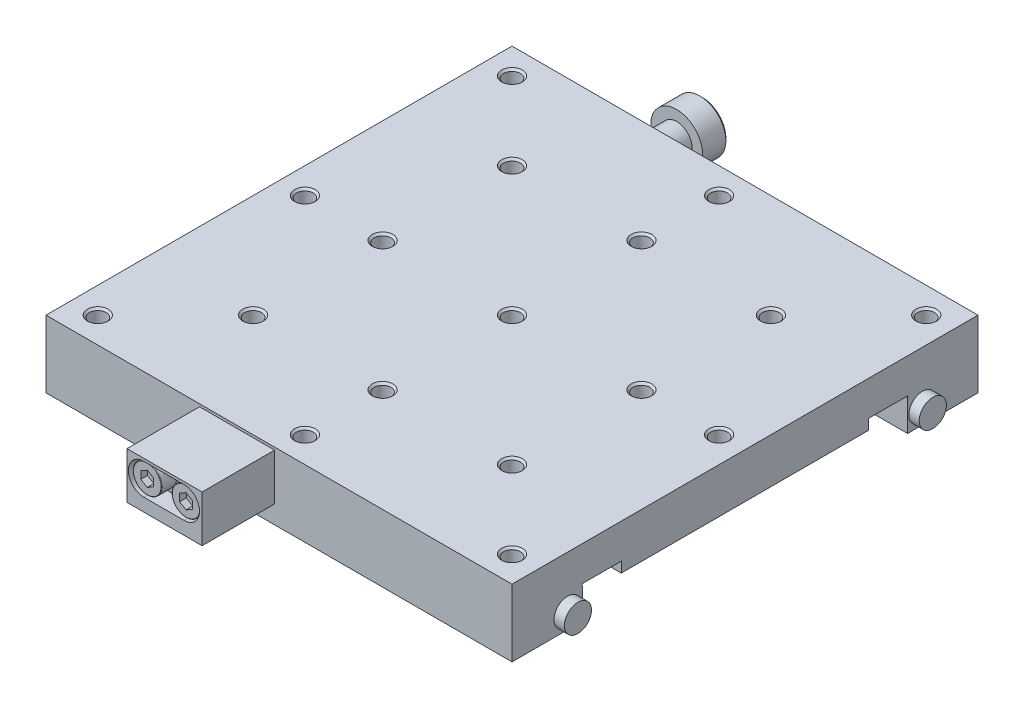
ISO-10303-21;
HEADER;
FILE_DESCRIPTION(('STEP AP214'),'2;1');
FILE_NAME('part.step','',(''),(''),'','','');
FILE_SCHEMA(('AUTOMOTIVE_DESIGN { 1 0 10303 214 1 1 1 1 }'));
ENDSEC;
DATA;
#1=APPLICATION_CONTEXT('core data for automotive mechanical design processes');
#2=APPLICATION_PROTOCOL_DEFINITION('international standard','automotive_design',2000,#1);
#3=PRODUCT_CONTEXT('',#1,'mechanical');
#4=PRODUCT('Part','Part','',(#3));
#5=PRODUCT_RELATED_PRODUCT_CATEGORY('part','',(#4));
#6=PRODUCT_DEFINITION_FORMATION('','',#4);
#7=PRODUCT_DEFINITION_CONTEXT('part definition',#1,'design');
#8=PRODUCT_DEFINITION('design','',#6,#7);
#9=PRODUCT_DEFINITION_SHAPE('','',#8);
#10=(LENGTH_UNIT() NAMED_UNIT(*) SI_UNIT(.MILLI.,.METRE.));
#11=(NAMED_UNIT(*) PLANE_ANGLE_UNIT() SI_UNIT($,.RADIAN.));
#12=(NAMED_UNIT(*) SI_UNIT($,.STERADIAN.) SOLID_ANGLE_UNIT());
#13=UNCERTAINTY_MEASURE_WITH_UNIT(LENGTH_MEASURE(1.E-05),#10,'distance_accuracy_value','');
#14=(GEOMETRIC_REPRESENTATION_CONTEXT(3) GLOBAL_UNCERTAINTY_ASSIGNED_CONTEXT((#13)) GLOBAL_UNIT_ASSIGNED_CONTEXT((#10,
#11,#12)) REPRESENTATION_CONTEXT('',''));
#15=CARTESIAN_POINT('',(0.,0.,0.));
#16=DIRECTION('',(0.,0.,1.));
#17=DIRECTION('',(1.,0.,0.));
#18=AXIS2_PLACEMENT_3D('',#15,#16,#17);
#19=CARTESIAN_POINT('',(45.,20.,45.));
#20=DIRECTION('',(0.,0.,-1.));
#21=DIRECTION('',(-1.,0.,0.));
#22=AXIS2_PLACEMENT_3D('',#19,#20,#21);
#23=PLANE('',#22);
#24=DIRECTION('',(0.,-1.,0.));
#25=VECTOR('',#24,1.);
#26=CARTESIAN_POINT('',(-45.,20.,45.));
#27=LINE('',#26,#25);
#28=CARTESIAN_POINT('',(-45.,20.,45.));
#29=VERTEX_POINT('',#28);
#30=CARTESIAN_POINT('',(-45.,7.,45.));
#31=VERTEX_POINT('',#30);
#32=EDGE_CURVE('E7',#29,#31,#27,.T.);
#33=ORIENTED_EDGE('',*,*,#32,.T.);
#34=DIRECTION('',(-1.,0.,0.));
#35=VECTOR('',#34,1.);
#36=CARTESIAN_POINT('',(45.,7.,45.));
#37=LINE('',#36,#35);
#38=CARTESIAN_POINT('',(45.,7.,45.));
#39=VERTEX_POINT('',#38);
#40=EDGE_CURVE('E14',#39,#31,#37,.T.);
#41=ORIENTED_EDGE('',*,*,#40,.F.);
#42=DIRECTION('',(0.,-1.,0.));
#43=VECTOR('',#42,1.);
#44=CARTESIAN_POINT('',(45.,20.,45.));
#45=LINE('',#44,#43);
#46=CARTESIAN_POINT('',(45.,20.,45.));
#47=VERTEX_POINT('',#46);
#48=EDGE_CURVE('E21',#47,#39,#45,.T.);
#49=ORIENTED_EDGE('',*,*,#48,.F.);
#50=DIRECTION('',(-1.,0.,0.));
#51=VECTOR('',#50,1.);
#52=CARTESIAN_POINT('',(45.,20.,45.));
#53=LINE('',#52,#51);
#54=EDGE_CURVE('E28',#47,#29,#53,.T.);
#55=ORIENTED_EDGE('',*,*,#54,.T.);
#56=EDGE_LOOP('',(#33,#41,#49,#55));
#57=FACE_BOUND('',#56,.T.);
#58=DIRECTION('',(0.,-1.,0.));
#59=VECTOR('',#58,1.);
#60=CARTESIAN_POINT('',(-15.35,19.5,45.));
#61=LINE('',#60,#59);
#62=CARTESIAN_POINT('',(-15.35,19.5,45.));
#63=VERTEX_POINT('',#62);
#64=CARTESIAN_POINT('',(-15.35,10.5,45.));
#65=VERTEX_POINT('',#64);
#66=EDGE_CURVE('E36',#63,#65,#61,.T.);
#67=ORIENTED_EDGE('',*,*,#66,.F.);
#68=DIRECTION('',(-1.,0.,0.));
#69=VECTOR('',#68,1.);
#70=CARTESIAN_POINT('',(-0.85,19.5,45.));
#71=LINE('',#70,#69);
#72=CARTESIAN_POINT('',(-0.85,19.5,45.));
#73=VERTEX_POINT('',#72);
#74=EDGE_CURVE('E43',#73,#63,#71,.T.);
#75=ORIENTED_EDGE('',*,*,#74,.F.);
#76=DIRECTION('',(0.,1.,0.));
#77=VECTOR('',#76,1.);
#78=CARTESIAN_POINT('',(-0.85,10.5,45.));
#79=LINE('',#78,#77);
#80=CARTESIAN_POINT('',(-0.85,10.5,45.));
#81=VERTEX_POINT('',#80);
#82=EDGE_CURVE('E50',#81,#73,#79,.T.);
#83=ORIENTED_EDGE('',*,*,#82,.F.);
#84=DIRECTION('',(1.,0.,0.));
#85=VECTOR('',#84,1.);
#86=CARTESIAN_POINT('',(-15.35,10.5,45.));
#87=LINE('',#86,#85);
#88=EDGE_CURVE('E57',#65,#81,#87,.T.);
#89=ORIENTED_EDGE('',*,*,#88,.F.);
#90=EDGE_LOOP('',(#67,#75,#83,#89));
#91=FACE_BOUND('',#90,.T.);
#92=ADVANCED_FACE('F63',(#57,#91),#23,.F.);
#93=CARTESIAN_POINT('',(-45.,0.,0.));
#94=DIRECTION('',(1.,0.,0.));
#95=DIRECTION('',(0.,0.,-1.));
#96=AXIS2_PLACEMENT_3D('',#93,#94,#95);
#97=PLANE('',#96);
#98=CARTESIAN_POINT('',(-45.,10.,34.27));
#99=DIRECTION('',(-1.,0.,0.));
#100=DIRECTION('',(0.,0.,-1.));
#101=AXIS2_PLACEMENT_3D('',#98,#99,#100);
#102=CIRCLE('',#101,2.625);
#103=CARTESIAN_POINT('',(-45.,10.,31.645));
#104=VERTEX_POINT('',#103);
#105=EDGE_CURVE('E74',#104,#104,#102,.T.);
#106=ORIENTED_EDGE('',*,*,#105,.F.);
#107=EDGE_LOOP('',(#106));
#108=FACE_BOUND('',#107,.T.);
#109=CARTESIAN_POINT('',(-45.,10.,-34.27));
#110=DIRECTION('',(-1.,0.,0.));
#111=DIRECTION('',(0.,0.,-1.));
#112=AXIS2_PLACEMENT_3D('',#109,#110,#111);
#113=CIRCLE('',#112,2.625);
#114=CARTESIAN_POINT('',(-45.,10.,-36.895));
#115=VERTEX_POINT('',#114);
#116=EDGE_CURVE('E78',#115,#115,#113,.T.);
#117=ORIENTED_EDGE('',*,*,#116,.F.);
#118=EDGE_LOOP('',(#117));
#119=FACE_BOUND('',#118,.T.);
#120=ORIENTED_EDGE('',*,*,#32,.F.);
#121=DIRECTION('',(0.,0.,1.));
#122=VECTOR('',#121,1.);
#123=CARTESIAN_POINT('',(-45.,20.,-45.));
#124=LINE('',#123,#122);
#125=CARTESIAN_POINT('',(-45.,20.,-45.));
#126=VERTEX_POINT('',#125);
#127=EDGE_CURVE('E85',#126,#29,#124,.T.);
#128=ORIENTED_EDGE('',*,*,#127,.F.);
#129=DIRECTION('',(0.,1.,0.));
#130=VECTOR('',#129,1.);
#131=CARTESIAN_POINT('',(-45.,7.,-45.));
#132=LINE('',#131,#130);
#133=CARTESIAN_POINT('',(-45.,7.,-45.));
#134=VERTEX_POINT('',#133);
#135=EDGE_CURVE('E92',#134,#126,#132,.T.);
#136=ORIENTED_EDGE('',*,*,#135,.F.);
#137=DIRECTION('',(0.,0.,-1.));
#138=VECTOR('',#137,1.);
#139=CARTESIAN_POINT('',(-45.,7.,-31.4));
#140=LINE('',#139,#138);
#141=CARTESIAN_POINT('',(-45.,7.,-31.4));
#142=VERTEX_POINT('',#141);
#143=EDGE_CURVE('E99',#142,#134,#140,.T.);
#144=ORIENTED_EDGE('',*,*,#143,.F.);
#145=DIRECTION('',(0.,-1.,0.));
#146=VECTOR('',#145,1.);
#147=CARTESIAN_POINT('',(-45.,13.,-31.4));
#148=LINE('',#147,#146);
#149=CARTESIAN_POINT('',(-45.,13.,-31.4));
#150=VERTEX_POINT('',#149);
#151=EDGE_CURVE('E106',#150,#142,#148,.T.);
#152=ORIENTED_EDGE('',*,*,#151,.F.);
#153=DIRECTION('',(0.,0.,1.));
#154=VECTOR('',#153,1.);
#155=CARTESIAN_POINT('',(-45.,13.,-31.5));
#156=LINE('',#155,#154);
#157=CARTESIAN_POINT('',(-45.,13.,-31.5));
#158=VERTEX_POINT('',#157);
#159=EDGE_CURVE('E113',#158,#150,#156,.T.);
#160=ORIENTED_EDGE('',*,*,#159,.F.);
#161=DIRECTION('',(0.,-1.,0.));
#162=VECTOR('',#161,1.);
#163=CARTESIAN_POINT('',(-45.,13.3,-31.5));
#164=LINE('',#163,#162);
#165=CARTESIAN_POINT('',(-45.,13.3,-31.5));
#166=VERTEX_POINT('',#165);
#167=EDGE_CURVE('E120',#166,#158,#164,.T.);
#168=ORIENTED_EDGE('',*,*,#167,.F.);
#169=DIRECTION('',(0.,0.,-1.));
#170=VECTOR('',#169,1.);
#171=CARTESIAN_POINT('',(-45.,13.3,-23.9));
#172=LINE('',#171,#170);
#173=CARTESIAN_POINT('',(-45.,13.3,-23.9));
#174=VERTEX_POINT('',#173);
#175=EDGE_CURVE('E127',#174,#166,#172,.T.);
#176=ORIENTED_EDGE('',*,*,#175,.F.);
#177=DIRECTION('',(0.,1.,0.));
#178=VECTOR('',#177,1.);
#179=CARTESIAN_POINT('',(-45.,11.3,-23.9));
#180=LINE('',#179,#178);
#181=CARTESIAN_POINT('',(-45.,11.3,-23.9));
#182=VERTEX_POINT('',#181);
#183=EDGE_CURVE('E134',#182,#174,#180,.T.);
#184=ORIENTED_EDGE('',*,*,#183,.F.);
#185=DIRECTION('',(0.,0.,-1.));
#186=VECTOR('',#185,1.);
#187=CARTESIAN_POINT('',(-45.,11.3,23.9));
#188=LINE('',#187,#186);
#189=CARTESIAN_POINT('',(-45.,11.3,23.9));
#190=VERTEX_POINT('',#189);
#191=EDGE_CURVE('E141',#190,#182,#188,.T.);
#192=ORIENTED_EDGE('',*,*,#191,.F.);
#193=DIRECTION('',(0.,-1.,0.));
#194=VECTOR('',#193,1.);
#195=CARTESIAN_POINT('',(-45.,13.3,23.9));
#196=LINE('',#195,#194);
#197=CARTESIAN_POINT('',(-45.,13.3,23.9));
#198=VERTEX_POINT('',#197);
#199=EDGE_CURVE('E148',#198,#190,#196,.T.);
#200=ORIENTED_EDGE('',*,*,#199,.F.);
#201=DIRECTION('',(0.,0.,-1.));
#202=VECTOR('',#201,1.);
#203=CARTESIAN_POINT('',(-45.,13.3,31.5));
#204=LINE('',#203,#202);
#205=CARTESIAN_POINT('',(-45.,13.3,31.5));
#206=VERTEX_POINT('',#205);
#207=EDGE_CURVE('E155',#206,#198,#204,.T.);
#208=ORIENTED_EDGE('',*,*,#207,.F.);
#209=DIRECTION('',(0.,1.,0.));
#210=VECTOR('',#209,1.);
#211=CARTESIAN_POINT('',(-45.,13.,31.5));
#212=LINE('',#211,#210);
#213=CARTESIAN_POINT('',(-45.,13.,31.5));
#214=VERTEX_POINT('',#213);
#215=EDGE_CURVE('E162',#214,#206,#212,.T.);
#216=ORIENTED_EDGE('',*,*,#215,.F.);
#217=DIRECTION('',(0.,0.,1.));
#218=VECTOR('',#217,1.);
#219=CARTESIAN_POINT('',(-45.,13.,31.4));
#220=LINE('',#219,#218);
#221=CARTESIAN_POINT('',(-45.,13.,31.4));
#222=VERTEX_POINT('',#221);
#223=EDGE_CURVE('E169',#222,#214,#220,.T.);
#224=ORIENTED_EDGE('',*,*,#223,.F.);
#225=DIRECTION('',(0.,1.,0.));
#226=VECTOR('',#225,1.);
#227=CARTESIAN_POINT('',(-45.,7.,31.4));
#228=LINE('',#227,#226);
#229=CARTESIAN_POINT('',(-45.,7.,31.4));
#230=VERTEX_POINT('',#229);
#231=EDGE_CURVE('E176',#230,#222,#228,.T.);
#232=ORIENTED_EDGE('',*,*,#231,.F.);
#233=DIRECTION('',(0.,0.,-1.));
#234=VECTOR('',#233,1.);
#235=CARTESIAN_POINT('',(-45.,7.,45.));
#236=LINE('',#235,#234);
#237=EDGE_CURVE('E183',#31,#230,#236,.T.);
#238=ORIENTED_EDGE('',*,*,#237,.F.);
#239=EDGE_LOOP('',(#120,#128,#136,#144,#152,#160,#168,#176,#184,#192,#200,#208,#216,#224,#232,#238));
#240=FACE_BOUND('',#239,.T.);
#241=ADVANCED_FACE('F187',(#108,#119,#240),#97,.F.);
#242=CARTESIAN_POINT('',(45.,7.,45.));
#243=DIRECTION('',(0.,1.,0.));
#244=DIRECTION('',(0.,0.,1.));
#245=AXIS2_PLACEMENT_3D('',#242,#243,#244);
#246=PLANE('',#245);
#247=ORIENTED_EDGE('',*,*,#237,.T.);
#248=DIRECTION('',(-1.,0.,0.));
#249=VECTOR('',#248,1.);
#250=CARTESIAN_POINT('',(45.,7.,31.4));
#251=LINE('',#250,#249);
#252=CARTESIAN_POINT('',(45.,7.,31.4));
#253=VERTEX_POINT('',#252);
#254=EDGE_CURVE('E197',#253,#230,#251,.T.);
#255=ORIENTED_EDGE('',*,*,#254,.F.);
#256=DIRECTION('',(0.,0.,-1.));
#257=VECTOR('',#256,1.);
#258=CARTESIAN_POINT('',(45.,7.,45.));
#259=LINE('',#258,#257);
#260=EDGE_CURVE('E204',#39,#253,#259,.T.);
#261=ORIENTED_EDGE('',*,*,#260,.F.);
#262=ORIENTED_EDGE('',*,*,#40,.T.);
#263=EDGE_LOOP('',(#247,#255,#261,#262));
#264=FACE_BOUND('',#263,.T.);
#265=ADVANCED_FACE('F209',(#264),#246,.F.);
#266=CARTESIAN_POINT('',(45.,0.,0.));
#267=DIRECTION('',(1.,0.,0.));
#268=DIRECTION('',(0.,0.,-1.));
#269=AXIS2_PLACEMENT_3D('',#266,#267,#268);
#270=PLANE('',#269);
#271=CARTESIAN_POINT('',(45.,10.,34.27));
#272=DIRECTION('',(1.,0.,0.));
#273=DIRECTION('',(0.,0.,-1.));
#274=AXIS2_PLACEMENT_3D('',#271,#272,#273);
#275=CIRCLE('',#274,2.625);
#276=CARTESIAN_POINT('',(45.,10.,31.645));
#277=VERTEX_POINT('',#276);
#278=EDGE_CURVE('E216',#277,#277,#275,.T.);
#279=ORIENTED_EDGE('',*,*,#278,.F.);
#280=EDGE_LOOP('',(#279));
#281=FACE_BOUND('',#280,.T.);
#282=CARTESIAN_POINT('',(45.,10.,-34.27));
#283=DIRECTION('',(1.,0.,0.));
#284=DIRECTION('',(0.,0.,-1.));
#285=AXIS2_PLACEMENT_3D('',#282,#283,#284);
#286=CIRCLE('',#285,2.625);
#287=CARTESIAN_POINT('',(45.,10.,-36.895));
#288=VERTEX_POINT('',#287);
#289=EDGE_CURVE('E220',#288,#288,#286,.T.);
#290=ORIENTED_EDGE('',*,*,#289,.F.);
#291=EDGE_LOOP('',(#290));
#292=FACE_BOUND('',#291,.T.);
#293=ORIENTED_EDGE('',*,*,#48,.T.);
#294=ORIENTED_EDGE('',*,*,#260,.T.);
#295=DIRECTION('',(0.,1.,0.));
#296=VECTOR('',#295,1.);
#297=CARTESIAN_POINT('',(45.,7.,31.4));
#298=LINE('',#297,#296);
#299=CARTESIAN_POINT('',(45.,13.,31.4));
#300=VERTEX_POINT('',#299);
#301=EDGE_CURVE('E228',#253,#300,#298,.T.);
#302=ORIENTED_EDGE('',*,*,#301,.T.);
#303=DIRECTION('',(0.,0.,1.));
#304=VECTOR('',#303,1.);
#305=CARTESIAN_POINT('',(45.,13.,31.4));
#306=LINE('',#305,#304);
#307=CARTESIAN_POINT('',(45.,13.,31.5));
#308=VERTEX_POINT('',#307);
#309=EDGE_CURVE('E235',#300,#308,#306,.T.);
#310=ORIENTED_EDGE('',*,*,#309,.T.);
#311=DIRECTION('',(0.,1.,0.));
#312=VECTOR('',#311,1.);
#313=CARTESIAN_POINT('',(45.,13.,31.5));
#314=LINE('',#313,#312);
#315=CARTESIAN_POINT('',(45.,13.3,31.5));
#316=VERTEX_POINT('',#315);
#317=EDGE_CURVE('E242',#308,#316,#314,.T.);
#318=ORIENTED_EDGE('',*,*,#317,.T.);
#319=DIRECTION('',(0.,0.,-1.));
#320=VECTOR('',#319,1.);
#321=CARTESIAN_POINT('',(45.,13.3,31.5));
#322=LINE('',#321,#320);
#323=CARTESIAN_POINT('',(45.,13.3,23.9));
#324=VERTEX_POINT('',#323);
#325=EDGE_CURVE('E249',#316,#324,#322,.T.);
#326=ORIENTED_EDGE('',*,*,#325,.T.);
#327=DIRECTION('',(0.,-1.,0.));
#328=VECTOR('',#327,1.);
#329=CARTESIAN_POINT('',(45.,13.3,23.9));
#330=LINE('',#329,#328);
#331=CARTESIAN_POINT('',(45.,11.3,23.9));
#332=VERTEX_POINT('',#331);
#333=EDGE_CURVE('E256',#324,#332,#330,.T.);
#334=ORIENTED_EDGE('',*,*,#333,.T.);
#335=DIRECTION('',(0.,0.,-1.));
#336=VECTOR('',#335,1.);
#337=CARTESIAN_POINT('',(45.,11.3,23.9));
#338=LINE('',#337,#336);
#339=CARTESIAN_POINT('',(45.,11.3,-23.9));
#340=VERTEX_POINT('',#339);
#341=EDGE_CURVE('E263',#332,#340,#338,.T.);
#342=ORIENTED_EDGE('',*,*,#341,.T.);
#343=DIRECTION('',(0.,1.,0.));
#344=VECTOR('',#343,1.);
#345=CARTESIAN_POINT('',(45.,11.3,-23.9));
#346=LINE('',#345,#344);
#347=CARTESIAN_POINT('',(45.,13.3,-23.9));
#348=VERTEX_POINT('',#347);
#349=EDGE_CURVE('E270',#340,#348,#346,.T.);
#350=ORIENTED_EDGE('',*,*,#349,.T.);
#351=DIRECTION('',(0.,0.,-1.));
#352=VECTOR('',#351,1.);
#353=CARTESIAN_POINT('',(45.,13.3,-23.9));
#354=LINE('',#353,#352);
#355=CARTESIAN_POINT('',(45.,13.3,-31.5));
#356=VERTEX_POINT('',#355);
#357=EDGE_CURVE('E277',#348,#356,#354,.T.);
#358=ORIENTED_EDGE('',*,*,#357,.T.);
#359=DIRECTION('',(0.,-1.,0.));
#360=VECTOR('',#359,1.);
#361=CARTESIAN_POINT('',(45.,13.3,-31.5));
#362=LINE('',#361,#360);
#363=CARTESIAN_POINT('',(45.,13.,-31.5));
#364=VERTEX_POINT('',#363);
#365=EDGE_CURVE('E284',#356,#364,#362,.T.);
#366=ORIENTED_EDGE('',*,*,#365,.T.);
#367=DIRECTION('',(0.,0.,1.));
#368=VECTOR('',#367,1.);
#369=CARTESIAN_POINT('',(45.,13.,-31.5));
#370=LINE('',#369,#368);
#371=CARTESIAN_POINT('',(45.,13.,-31.4));
#372=VERTEX_POINT('',#371);
#373=EDGE_CURVE('E291',#364,#372,#370,.T.);
#374=ORIENTED_EDGE('',*,*,#373,.T.);
#375=DIRECTION('',(0.,-1.,0.));
#376=VECTOR('',#375,1.);
#377=CARTESIAN_POINT('',(45.,13.,-31.4));
#378=LINE('',#377,#376);
#379=CARTESIAN_POINT('',(45.,7.,-31.4));
#380=VERTEX_POINT('',#379);
#381=EDGE_CURVE('E298',#372,#380,#378,.T.);
#382=ORIENTED_EDGE('',*,*,#381,.T.);
#383=DIRECTION('',(0.,0.,-1.));
#384=VECTOR('',#383,1.);
#385=CARTESIAN_POINT('',(45.,7.,-31.4));
#386=LINE('',#385,#384);
#387=CARTESIAN_POINT('',(45.,7.,-45.));
#388=VERTEX_POINT('',#387);
#389=EDGE_CURVE('E305',#380,#388,#386,.T.);
#390=ORIENTED_EDGE('',*,*,#389,.T.);
#391=DIRECTION('',(0.,1.,0.));
#392=VECTOR('',#391,1.);
#393=CARTESIAN_POINT('',(45.,7.,-45.));
#394=LINE('',#393,#392);
#395=CARTESIAN_POINT('',(45.,20.,-45.));
#396=VERTEX_POINT('',#395);
#397=EDGE_CURVE('E312',#388,#396,#394,.T.);
#398=ORIENTED_EDGE('',*,*,#397,.T.);
#399=DIRECTION('',(0.,0.,1.));
#400=VECTOR('',#399,1.);
#401=CARTESIAN_POINT('',(45.,20.,-45.));
#402=LINE('',#401,#400);
#403=EDGE_CURVE('E319',#396,#47,#402,.T.);
#404=ORIENTED_EDGE('',*,*,#403,.T.);
#405=EDGE_LOOP('',(#293,#294,#302,#310,#318,#326,#334,#342,#350,#358,#366,#374,#382,#390,#398,#404));
#406=FACE_BOUND('',#405,.T.);
#407=ADVANCED_FACE('F323',(#281,#292,#406),#270,.T.);
#408=CARTESIAN_POINT('',(45.,20.,-45.));
#409=DIRECTION('',(0.,-1.,0.));
#410=DIRECTION('',(0.,0.,-1.));
#411=AXIS2_PLACEMENT_3D('',#408,#409,#410);
#412=PLANE('',#411);
#413=CARTESIAN_POINT('',(40.,20.,40.));
#414=DIRECTION('',(0.,-1.,0.));
#415=DIRECTION('',(0.,0.,-1.));
#416=AXIS2_PLACEMENT_3D('',#413,#414,#415);
#417=CIRCLE('',#416,2.);
#418=CARTESIAN_POINT('',(40.,20.,38.));
#419=VERTEX_POINT('',#418);
#420=EDGE_CURVE('E330',#419,#419,#417,.T.);
#421=ORIENTED_EDGE('',*,*,#420,.T.);
#422=EDGE_LOOP('',(#421));
#423=FACE_BOUND('',#422,.T.);
#424=CARTESIAN_POINT('',(-40.,20.,0.));
#425=DIRECTION('',(0.,-1.,0.));
#426=DIRECTION('',(0.,0.,-1.));
#427=AXIS2_PLACEMENT_3D('',#424,#425,#426);
#428=CIRCLE('',#427,2.);
#429=CARTESIAN_POINT('',(-40.,20.,-2.));
#430=VERTEX_POINT('',#429);
#431=EDGE_CURVE('E334',#430,#430,#428,.T.);
#432=ORIENTED_EDGE('',*,*,#431,.T.);
#433=EDGE_LOOP('',(#432));
#434=FACE_BOUND('',#433,.T.);
#435=CARTESIAN_POINT('',(40.,20.,0.));
#436=DIRECTION('',(0.,-1.,0.));
#437=DIRECTION('',(0.,0.,-1.));
#438=AXIS2_PLACEMENT_3D('',#435,#436,#437);
#439=CIRCLE('',#438,2.);
#440=CARTESIAN_POINT('',(40.,20.,-2.));
#441=VERTEX_POINT('',#440);
#442=EDGE_CURVE('E338',#441,#441,#439,.T.);
#443=ORIENTED_EDGE('',*,*,#442,.T.);
#444=EDGE_LOOP('',(#443));
#445=FACE_BOUND('',#444,.T.);
#446=CARTESIAN_POINT('',(-40.,20.,-40.));
#447=DIRECTION('',(0.,-1.,0.));
#448=DIRECTION('',(0.,0.,-1.));
#449=AXIS2_PLACEMENT_3D('',#446,#447,#448);
#450=CIRCLE('',#449,2.);
#451=CARTESIAN_POINT('',(-40.,20.,-42.));
#452=VERTEX_POINT('',#451);
#453=EDGE_CURVE('E342',#452,#452,#450,.T.);
#454=ORIENTED_EDGE('',*,*,#453,.T.);
#455=EDGE_LOOP('',(#454));
#456=FACE_BOUND('',#455,.T.);
#457=CARTESIAN_POINT('',(0.,20.,40.));
#458=DIRECTION('',(0.,-1.,0.));
#459=DIRECTION('',(0.,0.,-1.));
#460=AXIS2_PLACEMENT_3D('',#457,#458,#459);
#461=CIRCLE('',#460,2.);
#462=CARTESIAN_POINT('',(0.,20.,38.));
#463=VERTEX_POINT('',#462);
#464=EDGE_CURVE('E346',#463,#463,#461,.T.);
#465=ORIENTED_EDGE('',*,*,#464,.T.);
#466=EDGE_LOOP('',(#465));
#467=FACE_BOUND('',#466,.T.);
#468=CARTESIAN_POINT('',(-40.,20.,40.));
#469=DIRECTION('',(0.,-1.,0.));
#470=DIRECTION('',(0.,0.,-1.));
#471=AXIS2_PLACEMENT_3D('',#468,#469,#470);
#472=CIRCLE('',#471,2.);
#473=CARTESIAN_POINT('',(-40.,20.,38.));
#474=VERTEX_POINT('',#473);
#475=EDGE_CURVE('E350',#474,#474,#472,.T.);
#476=ORIENTED_EDGE('',*,*,#475,.T.);
#477=EDGE_LOOP('',(#476));
#478=FACE_BOUND('',#477,.T.);
#479=CARTESIAN_POINT('',(0.,20.,-40.));
#480=DIRECTION('',(0.,-1.,0.));
#481=DIRECTION('',(0.,0.,-1.));
#482=AXIS2_PLACEMENT_3D('',#479,#480,#481);
#483=CIRCLE('',#482,2.);
#484=CARTESIAN_POINT('',(0.,20.,-42.));
#485=VERTEX_POINT('',#484);
#486=EDGE_CURVE('E354',#485,#485,#483,.T.);
#487=ORIENTED_EDGE('',*,*,#486,.T.);
#488=EDGE_LOOP('',(#487));
#489=FACE_BOUND('',#488,.T.);
#490=CARTESIAN_POINT('',(40.,20.,-40.));
#491=DIRECTION('',(0.,-1.,0.));
#492=DIRECTION('',(0.,0.,-1.));
#493=AXIS2_PLACEMENT_3D('',#490,#491,#492);
#494=CIRCLE('',#493,2.);
#495=CARTESIAN_POINT('',(40.,20.,-42.));
#496=VERTEX_POINT('',#495);
#497=EDGE_CURVE('E358',#496,#496,#494,.T.);
#498=ORIENTED_EDGE('',*,*,#497,.T.);
#499=EDGE_LOOP('',(#498));
#500=FACE_BOUND('',#499,.T.);
#501=CARTESIAN_POINT('',(25.,20.,25.));
#502=DIRECTION('',(0.,-1.,0.));
#503=DIRECTION('',(0.,0.,-1.));
#504=AXIS2_PLACEMENT_3D('',#501,#502,#503);
#505=CIRCLE('',#504,2.);
#506=CARTESIAN_POINT('',(25.,20.,23.));
#507=VERTEX_POINT('',#506);
#508=EDGE_CURVE('E362',#507,#507,#505,.T.);
#509=ORIENTED_EDGE('',*,*,#508,.T.);
#510=EDGE_LOOP('',(#509));
#511=FACE_BOUND('',#510,.T.);
#512=CARTESIAN_POINT('',(-25.,20.,0.));
#513=DIRECTION('',(0.,-1.,0.));
#514=DIRECTION('',(0.,0.,-1.));
#515=AXIS2_PLACEMENT_3D('',#512,#513,#514);
#516=CIRCLE('',#515,2.);
#517=CARTESIAN_POINT('',(-25.,20.,-2.));
#518=VERTEX_POINT('',#517);
#519=EDGE_CURVE('E366',#518,#518,#516,.T.);
#520=ORIENTED_EDGE('',*,*,#519,.T.);
#521=EDGE_LOOP('',(#520));
#522=FACE_BOUND('',#521,.T.);
#523=CARTESIAN_POINT('',(25.,20.,0.));
#524=DIRECTION('',(0.,-1.,0.));
#525=DIRECTION('',(0.,0.,-1.));
#526=AXIS2_PLACEMENT_3D('',#523,#524,#525);
#527=CIRCLE('',#526,2.);
#528=CARTESIAN_POINT('',(25.,20.,-2.));
#529=VERTEX_POINT('',#528);
#530=EDGE_CURVE('E370',#529,#529,#527,.T.);
#531=ORIENTED_EDGE('',*,*,#530,.T.);
#532=EDGE_LOOP('',(#531));
#533=FACE_BOUND('',#532,.T.);
#534=CARTESIAN_POINT('',(-25.,20.,-25.));
#535=DIRECTION('',(0.,-1.,0.));
#536=DIRECTION('',(0.,0.,-1.));
#537=AXIS2_PLACEMENT_3D('',#534,#535,#536);
#538=CIRCLE('',#537,2.);
#539=CARTESIAN_POINT('',(-25.,20.,-27.));
#540=VERTEX_POINT('',#539);
#541=EDGE_CURVE('E374',#540,#540,#538,.T.);
#542=ORIENTED_EDGE('',*,*,#541,.T.);
#543=EDGE_LOOP('',(#542));
#544=FACE_BOUND('',#543,.T.);
#545=CARTESIAN_POINT('',(0.,20.,25.));
#546=DIRECTION('',(0.,-1.,0.));
#547=DIRECTION('',(0.,0.,-1.));
#548=AXIS2_PLACEMENT_3D('',#545,#546,#547);
#549=CIRCLE('',#548,2.);
#550=CARTESIAN_POINT('',(0.,20.,23.));
#551=VERTEX_POINT('',#550);
#552=EDGE_CURVE('E378',#551,#551,#549,.T.);
#553=ORIENTED_EDGE('',*,*,#552,.T.);
#554=EDGE_LOOP('',(#553));
#555=FACE_BOUND('',#554,.T.);
#556=CARTESIAN_POINT('',(-25.,20.,25.));
#557=DIRECTION('',(0.,-1.,0.));
#558=DIRECTION('',(0.,0.,-1.));
#559=AXIS2_PLACEMENT_3D('',#556,#557,#558);
#560=CIRCLE('',#559,2.);
#561=CARTESIAN_POINT('',(-25.,20.,23.));
#562=VERTEX_POINT('',#561);
#563=EDGE_CURVE('E382',#562,#562,#560,.T.);
#564=ORIENTED_EDGE('',*,*,#563,.T.);
#565=EDGE_LOOP('',(#564));
#566=FACE_BOUND('',#565,.T.);
#567=CARTESIAN_POINT('',(0.,20.,-25.));
#568=DIRECTION('',(0.,-1.,0.));
#569=DIRECTION('',(0.,0.,-1.));
#570=AXIS2_PLACEMENT_3D('',#567,#568,#569);
#571=CIRCLE('',#570,2.);
#572=CARTESIAN_POINT('',(0.,20.,-27.));
#573=VERTEX_POINT('',#572);
#574=EDGE_CURVE('E386',#573,#573,#571,.T.);
#575=ORIENTED_EDGE('',*,*,#574,.T.);
#576=EDGE_LOOP('',(#575));
#577=FACE_BOUND('',#576,.T.);
#578=CARTESIAN_POINT('',(25.,20.,-25.));
#579=DIRECTION('',(0.,-1.,0.));
#580=DIRECTION('',(0.,0.,-1.));
#581=AXIS2_PLACEMENT_3D('',#578,#579,#580);
#582=CIRCLE('',#581,2.);
#583=CARTESIAN_POINT('',(25.,20.,-27.));
#584=VERTEX_POINT('',#583);
#585=EDGE_CURVE('E390',#584,#584,#582,.T.);
#586=ORIENTED_EDGE('',*,*,#585,.T.);
#587=EDGE_LOOP('',(#586));
#588=FACE_BOUND('',#587,.T.);
#589=CARTESIAN_POINT('',(0.,20.,0.));
#590=DIRECTION('',(0.,-1.,0.));
#591=DIRECTION('',(0.,0.,-1.));
#592=AXIS2_PLACEMENT_3D('',#589,#590,#591);
#593=CIRCLE('',#592,2.);
#594=CARTESIAN_POINT('',(0.,20.,-2.));
#595=VERTEX_POINT('',#594);
#596=EDGE_CURVE('E394',#595,#595,#593,.T.);
#597=ORIENTED_EDGE('',*,*,#596,.T.);
#598=EDGE_LOOP('',(#597));
#599=FACE_BOUND('',#598,.T.);
#600=ORIENTED_EDGE('',*,*,#127,.T.);
#601=ORIENTED_EDGE('',*,*,#54,.F.);
#602=ORIENTED_EDGE('',*,*,#403,.F.);
#603=DIRECTION('',(-1.,0.,0.));
#604=VECTOR('',#603,1.);
#605=CARTESIAN_POINT('',(45.,20.,-45.));
#606=LINE('',#605,#604);
#607=EDGE_CURVE('E403',#396,#126,#606,.T.);
#608=ORIENTED_EDGE('',*,*,#607,.T.);
#609=EDGE_LOOP('',(#600,#601,#602,#608));
#610=FACE_BOUND('',#609,.T.);
#611=ADVANCED_FACE('F407',(#423,#434,#445,#456,#467,#478,#489,#500,#511,#522,#533,#544,#555,
#566,#577,#588,#599,#610),#412,.F.);
#612=CARTESIAN_POINT('',(-15.35,19.5,45.));
#613=DIRECTION('',(-1.,0.,0.));
#614=DIRECTION('',(0.,0.,1.));
#615=AXIS2_PLACEMENT_3D('',#612,#613,#614);
#616=PLANE('',#615);
#617=DIRECTION('',(0.,-1.,0.));
#618=VECTOR('',#617,1.);
#619=CARTESIAN_POINT('',(-15.35,19.5,59.));
#620=LINE('',#619,#618);
#621=CARTESIAN_POINT('',(-15.35,19.5,59.));
#622=VERTEX_POINT('',#621);
#623=CARTESIAN_POINT('',(-15.35,10.5,59.));
#624=VERTEX_POINT('',#623);
#625=EDGE_CURVE('E416',#622,#624,#620,.T.);
#626=ORIENTED_EDGE('',*,*,#625,.F.);
#627=DIRECTION('',(0.,0.,1.));
#628=VECTOR('',#627,1.);
#629=CARTESIAN_POINT('',(-15.35,19.5,45.));
#630=LINE('',#629,#628);
#631=EDGE_CURVE('E423',#63,#622,#630,.T.);
#632=ORIENTED_EDGE('',*,*,#631,.F.);
#633=ORIENTED_EDGE('',*,*,#66,.T.);
#634=DIRECTION('',(0.,0.,1.));
#635=VECTOR('',#634,1.);
#636=CARTESIAN_POINT('',(-15.35,10.5,45.));
#637=LINE('',#636,#635);
#638=EDGE_CURVE('E429',#65,#624,#637,.T.);
#639=ORIENTED_EDGE('',*,*,#638,.T.);
#640=EDGE_LOOP('',(#626,#632,#633,#639));
#641=FACE_BOUND('',#640,.T.);
#642=ADVANCED_FACE('F435',(#641),#616,.T.);
#643=CARTESIAN_POINT('',(-0.85,19.5,45.));
#644=DIRECTION('',(0.,1.,0.));
#645=DIRECTION('',(0.,0.,1.));
#646=AXIS2_PLACEMENT_3D('',#643,#644,#645);
#647=PLANE('',#646);
#648=DIRECTION('',(-1.,0.,0.));
#649=VECTOR('',#648,1.);
#650=CARTESIAN_POINT('',(-0.85,19.5,59.));
#651=LINE('',#650,#649);
#652=CARTESIAN_POINT('',(-0.85,19.5,59.));
#653=VERTEX_POINT('',#652);
#654=EDGE_CURVE('E444',#653,#622,#651,.T.);
#655=ORIENTED_EDGE('',*,*,#654,.F.);
#656=DIRECTION('',(0.,0.,1.));
#657=VECTOR('',#656,1.);
#658=CARTESIAN_POINT('',(-0.85,19.5,45.));
#659=LINE('',#658,#657);
#660=EDGE_CURVE('E451',#73,#653,#659,.T.);
#661=ORIENTED_EDGE('',*,*,#660,.F.);
#662=ORIENTED_EDGE('',*,*,#74,.T.);
#663=ORIENTED_EDGE('',*,*,#631,.T.);
#664=EDGE_LOOP('',(#655,#661,#662,#663));
#665=FACE_BOUND('',#664,.T.);
#666=ADVANCED_FACE('F457',(#665),#647,.T.);
#667=CARTESIAN_POINT('',(-0.85,10.5,45.));
#668=DIRECTION('',(1.,0.,0.));
#669=DIRECTION('',(0.,0.,-1.));
#670=AXIS2_PLACEMENT_3D('',#667,#668,#669);
#671=PLANE('',#670);
#672=DIRECTION('',(0.,1.,0.));
#673=VECTOR('',#672,1.);
#674=CARTESIAN_POINT('',(-0.85,10.5,59.));
#675=LINE('',#674,#673);
#676=CARTESIAN_POINT('',(-0.85,10.5,59.));
#677=VERTEX_POINT('',#676);
#678=EDGE_CURVE('E466',#677,#653,#675,.T.);
#679=ORIENTED_EDGE('',*,*,#678,.F.);
#680=DIRECTION('',(0.,0.,1.));
#681=VECTOR('',#680,1.);
#682=CARTESIAN_POINT('',(-0.85,10.5,45.));
#683=LINE('',#682,#681);
#684=EDGE_CURVE('E473',#81,#677,#683,.T.);
#685=ORIENTED_EDGE('',*,*,#684,.F.);
#686=ORIENTED_EDGE('',*,*,#82,.T.);
#687=ORIENTED_EDGE('',*,*,#660,.T.);
#688=EDGE_LOOP('',(#679,#685,#686,#687));
#689=FACE_BOUND('',#688,.T.);
#690=ADVANCED_FACE('F479',(#689),#671,.T.);
#691=CARTESIAN_POINT('',(-15.35,10.5,45.));
#692=DIRECTION('',(0.,-1.,0.));
#693=DIRECTION('',(0.,0.,-1.));
#694=AXIS2_PLACEMENT_3D('',#691,#692,#693);
#695=PLANE('',#694);
#696=DIRECTION('',(1.,0.,0.));
#697=VECTOR('',#696,1.);
#698=CARTESIAN_POINT('',(-15.35,10.5,59.));
#699=LINE('',#698,#697);
#700=EDGE_CURVE('E488',#624,#677,#699,.T.);
#701=ORIENTED_EDGE('',*,*,#700,.F.);
#702=ORIENTED_EDGE('',*,*,#638,.F.);
#703=ORIENTED_EDGE('',*,*,#88,.T.);
#704=ORIENTED_EDGE('',*,*,#684,.T.);
#705=EDGE_LOOP('',(#701,#702,#703,#704));
#706=FACE_BOUND('',#705,.T.);
#707=ADVANCED_FACE('F495',(#706),#695,.T.);
#708=CARTESIAN_POINT('',(-45.,10.,34.27));
#709=DIRECTION('',(1.,0.,0.));
#710=DIRECTION('',(0.,0.,-1.));
#711=AXIS2_PLACEMENT_3D('',#708,#709,#710);
#712=CYLINDRICAL_SURFACE('',#711,2.625);
#713=ORIENTED_EDGE('',*,*,#105,.T.);
#714=EDGE_LOOP('',(#713));
#715=FACE_BOUND('',#714,.T.);
#716=CARTESIAN_POINT('',(-47.,10.,34.27));
#717=DIRECTION('',(1.,0.,0.));
#718=DIRECTION('',(0.,0.,-1.));
#719=AXIS2_PLACEMENT_3D('',#716,#717,#718);
#720=CIRCLE('',#719,2.625);
#721=CARTESIAN_POINT('',(-47.,10.,31.645));
#722=VERTEX_POINT('',#721);
#723=EDGE_CURVE('E504',#722,#722,#720,.T.);
#724=ORIENTED_EDGE('',*,*,#723,.T.);
#725=EDGE_LOOP('',(#724));
#726=FACE_BOUND('',#725,.T.);
#727=ADVANCED_FACE('F508',(#715,#726),#712,.T.);
#728=CARTESIAN_POINT('',(-45.,10.,-34.27));
#729=DIRECTION('',(1.,0.,0.));
#730=DIRECTION('',(0.,0.,-1.));
#731=AXIS2_PLACEMENT_3D('',#728,#729,#730);
#732=CYLINDRICAL_SURFACE('',#731,2.625);
#733=ORIENTED_EDGE('',*,*,#116,.T.);
#734=EDGE_LOOP('',(#733));
#735=FACE_BOUND('',#734,.T.);
#736=CARTESIAN_POINT('',(-47.,10.,-34.27));
#737=DIRECTION('',(1.,0.,0.));
#738=DIRECTION('',(0.,0.,-1.));
#739=AXIS2_PLACEMENT_3D('',#736,#737,#738);
#740=CIRCLE('',#739,2.625);
#741=CARTESIAN_POINT('',(-47.,10.,-36.895));
#742=VERTEX_POINT('',#741);
#743=EDGE_CURVE('E517',#742,#742,#740,.T.);
#744=ORIENTED_EDGE('',*,*,#743,.T.);
#745=EDGE_LOOP('',(#744));
#746=FACE_BOUND('',#745,.T.);
#747=ADVANCED_FACE('F521',(#735,#746),#732,.T.);
#748=CARTESIAN_POINT('',(45.,7.,-45.));
#749=DIRECTION('',(0.,0.,1.));
#750=DIRECTION('',(1.,0.,0.));
#751=AXIS2_PLACEMENT_3D('',#748,#749,#750);
#752=PLANE('',#751);
#753=CARTESIAN_POINT('',(-19.,14.5,-45.));
#754=DIRECTION('',(0.,0.,-1.));
#755=DIRECTION('',(1.,0.,0.));
#756=AXIS2_PLACEMENT_3D('',#753,#754,#755);
#757=CIRCLE('',#756,1.5);
#758=CARTESIAN_POINT('',(-17.5,14.5,-45.));
#759=VERTEX_POINT('',#758);
#760=EDGE_CURVE('E528',#759,#759,#757,.T.);
#761=ORIENTED_EDGE('',*,*,#760,.F.);
#762=EDGE_LOOP('',(#761));
#763=FACE_BOUND('',#762,.T.);
#764=ORIENTED_EDGE('',*,*,#135,.T.);
#765=ORIENTED_EDGE('',*,*,#607,.F.);
#766=ORIENTED_EDGE('',*,*,#397,.F.);
#767=DIRECTION('',(-1.,0.,0.));
#768=VECTOR('',#767,1.);
#769=CARTESIAN_POINT('',(45.,7.,-45.));
#770=LINE('',#769,#768);
#771=EDGE_CURVE('E537',#388,#134,#770,.T.);
#772=ORIENTED_EDGE('',*,*,#771,.T.);
#773=EDGE_LOOP('',(#764,#765,#766,#772));
#774=FACE_BOUND('',#773,.T.);
#775=ADVANCED_FACE('F541',(#763,#774),#752,.F.);
#776=CARTESIAN_POINT('',(45.,7.,-31.4));
#777=DIRECTION('',(0.,1.,0.));
#778=DIRECTION('',(0.,0.,1.));
#779=AXIS2_PLACEMENT_3D('',#776,#777,#778);
#780=PLANE('',#779);
#781=ORIENTED_EDGE('',*,*,#143,.T.);
#782=ORIENTED_EDGE('',*,*,#771,.F.);
#783=ORIENTED_EDGE('',*,*,#389,.F.);
#784=DIRECTION('',(-1.,0.,0.));
#785=VECTOR('',#784,1.);
#786=CARTESIAN_POINT('',(45.,7.,-31.4));
#787=LINE('',#786,#785);
#788=EDGE_CURVE('E553',#380,#142,#787,.T.);
#789=ORIENTED_EDGE('',*,*,#788,.T.);
#790=EDGE_LOOP('',(#781,#782,#783,#789));
#791=FACE_BOUND('',#790,.T.);
#792=ADVANCED_FACE('F557',(#791),#780,.F.);
#793=CARTESIAN_POINT('',(45.,13.,-31.4));
#794=DIRECTION('',(0.,0.,-1.));
#795=DIRECTION('',(-1.,0.,0.));
#796=AXIS2_PLACEMENT_3D('',#793,#794,#795);
#797=PLANE('',#796);
#798=ORIENTED_EDGE('',*,*,#151,.T.);
#799=ORIENTED_EDGE('',*,*,#788,.F.);
#800=ORIENTED_EDGE('',*,*,#381,.F.);
#801=DIRECTION('',(-1.,0.,0.));
#802=VECTOR('',#801,1.);
#803=CARTESIAN_POINT('',(45.,13.,-31.4));
#804=LINE('',#803,#802);
#805=EDGE_CURVE('E569',#372,#150,#804,.T.);
#806=ORIENTED_EDGE('',*,*,#805,.T.);
#807=EDGE_LOOP('',(#798,#799,#800,#806));
#808=FACE_BOUND('',#807,.T.);
#809=ADVANCED_FACE('F573',(#808),#797,.F.);
#810=CARTESIAN_POINT('',(45.,13.,-31.5));
#811=DIRECTION('',(0.,-1.,0.));
#812=DIRECTION('',(0.,0.,-1.));
#813=AXIS2_PLACEMENT_3D('',#810,#811,#812);
#814=PLANE('',#813);
#815=ORIENTED_EDGE('',*,*,#159,.T.);
#816=ORIENTED_EDGE('',*,*,#805,.F.);
#817=ORIENTED_EDGE('',*,*,#373,.F.);
#818=DIRECTION('',(-1.,0.,0.));
#819=VECTOR('',#818,1.);
#820=CARTESIAN_POINT('',(45.,13.,-31.5));
#821=LINE('',#820,#819);
#822=EDGE_CURVE('E585',#364,#158,#821,.T.);
#823=ORIENTED_EDGE('',*,*,#822,.T.);
#824=EDGE_LOOP('',(#815,#816,#817,#823));
#825=FACE_BOUND('',#824,.T.);
#826=ADVANCED_FACE('F589',(#825),#814,.F.);
#827=CARTESIAN_POINT('',(45.,13.3,-31.5));
#828=DIRECTION('',(0.,0.,-1.));
#829=DIRECTION('',(-1.,0.,0.));
#830=AXIS2_PLACEMENT_3D('',#827,#828,#829);
#831=PLANE('',#830);
#832=ORIENTED_EDGE('',*,*,#167,.T.);
#833=ORIENTED_EDGE('',*,*,#822,.F.);
#834=ORIENTED_EDGE('',*,*,#365,.F.);
#835=DIRECTION('',(-1.,0.,0.));
#836=VECTOR('',#835,1.);
#837=CARTESIAN_POINT('',(45.,13.3,-31.5));
#838=LINE('',#837,#836);
#839=EDGE_CURVE('E601',#356,#166,#838,.T.);
#840=ORIENTED_EDGE('',*,*,#839,.T.);
#841=EDGE_LOOP('',(#832,#833,#834,#840));
#842=FACE_BOUND('',#841,.T.);
#843=ADVANCED_FACE('F605',(#842),#831,.F.);
#844=CARTESIAN_POINT('',(45.,13.3,31.5));
#845=DIRECTION('',(0.,1.,0.));
#846=DIRECTION('',(0.,0.,1.));
#847=AXIS2_PLACEMENT_3D('',#844,#845,#846);
#848=PLANE('',#847);
#849=CARTESIAN_POINT('',(25.,13.3,25.));
#850=DIRECTION('',(0.,-1.,0.));
#851=DIRECTION('',(0.,0.,-1.));
#852=AXIS2_PLACEMENT_3D('',#849,#850,#851);
#853=CIRCLE('',#852,1.621);
#854=CARTESIAN_POINT('',(25.,13.3,23.379));
#855=VERTEX_POINT('',#854);
#856=EDGE_CURVE('E612',#855,#855,#853,.T.);
#857=ORIENTED_EDGE('',*,*,#856,.F.);
#858=EDGE_LOOP('',(#857));
#859=FACE_BOUND('',#858,.T.);
#860=CARTESIAN_POINT('',(-25.,13.3,0.));
#861=DIRECTION('',(0.,-1.,0.));
#862=DIRECTION('',(0.,0.,-1.));
#863=AXIS2_PLACEMENT_3D('',#860,#861,#862);
#864=CIRCLE('',#863,1.621);
#865=CARTESIAN_POINT('',(-25.,13.3,-1.621));
#866=VERTEX_POINT('',#865);
#867=EDGE_CURVE('E616',#866,#866,#864,.T.);
#868=ORIENTED_EDGE('',*,*,#867,.F.);
#869=EDGE_LOOP('',(#868));
#870=FACE_BOUND('',#869,.T.);
#871=CARTESIAN_POINT('',(25.,13.3,0.));
#872=DIRECTION('',(0.,-1.,0.));
#873=DIRECTION('',(0.,0.,-1.));
#874=AXIS2_PLACEMENT_3D('',#871,#872,#873);
#875=CIRCLE('',#874,1.621);
#876=CARTESIAN_POINT('',(25.,13.3,-1.621));
#877=VERTEX_POINT('',#876);
#878=EDGE_CURVE('E620',#877,#877,#875,.T.);
#879=ORIENTED_EDGE('',*,*,#878,.F.);
#880=EDGE_LOOP('',(#879));
#881=FACE_BOUND('',#880,.T.);
#882=CARTESIAN_POINT('',(-25.,13.3,-25.));
#883=DIRECTION('',(0.,-1.,0.));
#884=DIRECTION('',(0.,0.,-1.));
#885=AXIS2_PLACEMENT_3D('',#882,#883,#884);
#886=CIRCLE('',#885,1.621);
#887=CARTESIAN_POINT('',(-25.,13.3,-26.621));
#888=VERTEX_POINT('',#887);
#889=EDGE_CURVE('E624',#888,#888,#886,.T.);
#890=ORIENTED_EDGE('',*,*,#889,.F.);
#891=EDGE_LOOP('',(#890));
#892=FACE_BOUND('',#891,.T.);
#893=CARTESIAN_POINT('',(0.,13.3,25.));
#894=DIRECTION('',(0.,-1.,0.));
#895=DIRECTION('',(0.,0.,-1.));
#896=AXIS2_PLACEMENT_3D('',#893,#894,#895);
#897=CIRCLE('',#896,1.621);
#898=CARTESIAN_POINT('',(0.,13.3,23.379));
#899=VERTEX_POINT('',#898);
#900=EDGE_CURVE('E628',#899,#899,#897,.T.);
#901=ORIENTED_EDGE('',*,*,#900,.F.);
#902=EDGE_LOOP('',(#901));
#903=FACE_BOUND('',#902,.T.);
#904=CARTESIAN_POINT('',(-25.,13.3,25.));
#905=DIRECTION('',(0.,-1.,0.));
#906=DIRECTION('',(0.,0.,-1.));
#907=AXIS2_PLACEMENT_3D('',#904,#905,#906);
#908=CIRCLE('',#907,1.621);
#909=CARTESIAN_POINT('',(-25.,13.3,23.379));
#910=VERTEX_POINT('',#909);
#911=EDGE_CURVE('E632',#910,#910,#908,.T.);
#912=ORIENTED_EDGE('',*,*,#911,.F.);
#913=EDGE_LOOP('',(#912));
#914=FACE_BOUND('',#913,.T.);
#915=CARTESIAN_POINT('',(0.,13.3,-25.));
#916=DIRECTION('',(0.,-1.,0.));
#917=DIRECTION('',(0.,0.,-1.));
#918=AXIS2_PLACEMENT_3D('',#915,#916,#917);
#919=CIRCLE('',#918,1.621);
#920=CARTESIAN_POINT('',(0.,13.3,-26.621));
#921=VERTEX_POINT('',#920);
#922=EDGE_CURVE('E636',#921,#921,#919,.T.);
#923=ORIENTED_EDGE('',*,*,#922,.F.);
#924=EDGE_LOOP('',(#923));
#925=FACE_BOUND('',#924,.T.);
#926=CARTESIAN_POINT('',(25.,13.3,-25.));
#927=DIRECTION('',(0.,-1.,0.));
#928=DIRECTION('',(0.,0.,-1.));
#929=AXIS2_PLACEMENT_3D('',#926,#927,#928);
#930=CIRCLE('',#929,1.621);
#931=CARTESIAN_POINT('',(25.,13.3,-26.621));
#932=VERTEX_POINT('',#931);
#933=EDGE_CURVE('E640',#932,#932,#930,.T.);
#934=ORIENTED_EDGE('',*,*,#933,.F.);
#935=EDGE_LOOP('',(#934));
#936=FACE_BOUND('',#935,.T.);
#937=CARTESIAN_POINT('',(0.,13.3,0.));
#938=DIRECTION('',(0.,-1.,0.));
#939=DIRECTION('',(0.,0.,-1.));
#940=AXIS2_PLACEMENT_3D('',#937,#938,#939);
#941=CIRCLE('',#940,1.621);
#942=CARTESIAN_POINT('',(0.,13.3,-1.621));
#943=VERTEX_POINT('',#942);
#944=EDGE_CURVE('E644',#943,#943,#941,.T.);
#945=ORIENTED_EDGE('',*,*,#944,.F.);
#946=EDGE_LOOP('',(#945));
#947=FACE_BOUND('',#946,.T.);
#948=DIRECTION('',(-1.,0.,0.));
#949=VECTOR('',#948,1.);
#950=CARTESIAN_POINT('',(-35.,13.3,23.9));
#951=LINE('',#950,#949);
#952=CARTESIAN_POINT('',(-35.,13.3,23.9));
#953=VERTEX_POINT('',#952);
#954=EDGE_CURVE('E650',#953,#198,#951,.T.);
#955=ORIENTED_EDGE('',*,*,#954,.F.);
#956=DIRECTION('',(0.,0.,1.));
#957=VECTOR('',#956,1.);
#958=CARTESIAN_POINT('',(-35.,13.3,-23.9));
#959=LINE('',#958,#957);
#960=CARTESIAN_POINT('',(-35.,13.3,-23.9));
#961=VERTEX_POINT('',#960);
#962=EDGE_CURVE('E657',#961,#953,#959,.T.);
#963=ORIENTED_EDGE('',*,*,#962,.F.);
#964=DIRECTION('',(-1.,0.,0.));
#965=VECTOR('',#964,1.);
#966=CARTESIAN_POINT('',(-35.,13.3,-23.9));
#967=LINE('',#966,#965);
#968=EDGE_CURVE('E664',#961,#174,#967,.T.);
#969=ORIENTED_EDGE('',*,*,#968,.T.);
#970=ORIENTED_EDGE('',*,*,#175,.T.);
#971=ORIENTED_EDGE('',*,*,#839,.F.);
#972=ORIENTED_EDGE('',*,*,#357,.F.);
#973=DIRECTION('',(1.,0.,0.));
#974=VECTOR('',#973,1.);
#975=CARTESIAN_POINT('',(35.,13.3,-23.9));
#976=LINE('',#975,#974);
#977=CARTESIAN_POINT('',(35.,13.3,-23.9));
#978=VERTEX_POINT('',#977);
#979=EDGE_CURVE('E672',#978,#348,#976,.T.);
#980=ORIENTED_EDGE('',*,*,#979,.F.);
#981=DIRECTION('',(0.,0.,1.));
#982=VECTOR('',#981,1.);
#983=CARTESIAN_POINT('',(35.,13.3,-23.9));
#984=LINE('',#983,#982);
#985=CARTESIAN_POINT('',(35.,13.3,23.9));
#986=VERTEX_POINT('',#985);
#987=EDGE_CURVE('E679',#978,#986,#984,.T.);
#988=ORIENTED_EDGE('',*,*,#987,.T.);
#989=DIRECTION('',(1.,0.,0.));
#990=VECTOR('',#989,1.);
#991=CARTESIAN_POINT('',(35.,13.3,23.9));
#992=LINE('',#991,#990);
#993=EDGE_CURVE('E686',#986,#324,#992,.T.);
#994=ORIENTED_EDGE('',*,*,#993,.T.);
#995=ORIENTED_EDGE('',*,*,#325,.F.);
#996=DIRECTION('',(-1.,0.,0.));
#997=VECTOR('',#996,1.);
#998=CARTESIAN_POINT('',(45.,13.3,31.5));
#999=LINE('',#998,#997);
#1000=EDGE_CURVE('E692',#316,#206,#999,.T.);
#1001=ORIENTED_EDGE('',*,*,#1000,.T.);
#1002=ORIENTED_EDGE('',*,*,#207,.T.);
#1003=EDGE_LOOP('',(#955,#963,#969,#970,#971,#972,#980,#988,#994,#995,#1001,#1002));
#1004=FACE_BOUND('',#1003,.T.);
#1005=ADVANCED_FACE('F697',(#859,#870,#881,#892,#903,#914,#925,#936,#947,#1004),#848,.F.);
#1006=CARTESIAN_POINT('',(-35.,11.3,-23.9));
#1007=DIRECTION('',(0.,0.,1.));
#1008=DIRECTION('',(1.,0.,0.));
#1009=AXIS2_PLACEMENT_3D('',#1006,#1007,#1008);
#1010=PLANE('',#1009);
#1011=ORIENTED_EDGE('',*,*,#183,.T.);
#1012=ORIENTED_EDGE('',*,*,#968,.F.);
#1013=DIRECTION('',(0.,1.,0.));
#1014=VECTOR('',#1013,1.);
#1015=CARTESIAN_POINT('',(-35.,11.3,-23.9));
#1016=LINE('',#1015,#1014);
#1017=CARTESIAN_POINT('',(-35.,11.3,-23.9));
#1018=VERTEX_POINT('',#1017);
#1019=EDGE_CURVE('E708',#1018,#961,#1016,.T.);
#1020=ORIENTED_EDGE('',*,*,#1019,.F.);
#1021=DIRECTION('',(-1.,0.,0.));
#1022=VECTOR('',#1021,1.);
#1023=CARTESIAN_POINT('',(-35.,11.3,-23.9));
#1024=LINE('',#1023,#1022);
#1025=EDGE_CURVE('E715',#1018,#182,#1024,.T.);
#1026=ORIENTED_EDGE('',*,*,#1025,.T.);
#1027=EDGE_LOOP('',(#1011,#1012,#1020,#1026));
#1028=FACE_BOUND('',#1027,.T.);
#1029=ADVANCED_FACE('F719',(#1028),#1010,.F.);
#1030=CARTESIAN_POINT('',(-35.,11.3,23.9));
#1031=DIRECTION('',(0.,1.,0.));
#1032=DIRECTION('',(0.,0.,1.));
#1033=AXIS2_PLACEMENT_3D('',#1030,#1031,#1032);
#1034=PLANE('',#1033);
#1035=ORIENTED_EDGE('',*,*,#191,.T.);
#1036=ORIENTED_EDGE('',*,*,#1025,.F.);
#1037=DIRECTION('',(0.,0.,-1.));
#1038=VECTOR('',#1037,1.);
#1039=CARTESIAN_POINT('',(-35.,11.3,23.9));
#1040=LINE('',#1039,#1038);
#1041=CARTESIAN_POINT('',(-35.,11.3,23.9));
#1042=VERTEX_POINT('',#1041);
#1043=EDGE_CURVE('E730',#1042,#1018,#1040,.T.);
#1044=ORIENTED_EDGE('',*,*,#1043,.F.);
#1045=DIRECTION('',(-1.,0.,0.));
#1046=VECTOR('',#1045,1.);
#1047=CARTESIAN_POINT('',(-35.,11.3,23.9));
#1048=LINE('',#1047,#1046);
#1049=EDGE_CURVE('E737',#1042,#190,#1048,.T.);
#1050=ORIENTED_EDGE('',*,*,#1049,.T.);
#1051=EDGE_LOOP('',(#1035,#1036,#1044,#1050));
#1052=FACE_BOUND('',#1051,.T.);
#1053=ADVANCED_FACE('F741',(#1052),#1034,.F.);
#1054=CARTESIAN_POINT('',(-35.,13.3,23.9));
#1055=DIRECTION('',(0.,0.,-1.));
#1056=DIRECTION('',(-1.,0.,0.));
#1057=AXIS2_PLACEMENT_3D('',#1054,#1055,#1056);
#1058=PLANE('',#1057);
#1059=ORIENTED_EDGE('',*,*,#199,.T.);
#1060=ORIENTED_EDGE('',*,*,#1049,.F.);
#1061=DIRECTION('',(0.,-1.,0.));
#1062=VECTOR('',#1061,1.);
#1063=CARTESIAN_POINT('',(-35.,13.3,23.9));
#1064=LINE('',#1063,#1062);
#1065=EDGE_CURVE('E752',#953,#1042,#1064,.T.);
#1066=ORIENTED_EDGE('',*,*,#1065,.F.);
#1067=ORIENTED_EDGE('',*,*,#954,.T.);
#1068=EDGE_LOOP('',(#1059,#1060,#1066,#1067));
#1069=FACE_BOUND('',#1068,.T.);
#1070=ADVANCED_FACE('F757',(#1069),#1058,.F.);
#1071=CARTESIAN_POINT('',(45.,13.,31.5));
#1072=DIRECTION('',(0.,0.,1.));
#1073=DIRECTION('',(1.,0.,0.));
#1074=AXIS2_PLACEMENT_3D('',#1071,#1072,#1073);
#1075=PLANE('',#1074);
#1076=ORIENTED_EDGE('',*,*,#215,.T.);
#1077=ORIENTED_EDGE('',*,*,#1000,.F.);
#1078=ORIENTED_EDGE('',*,*,#317,.F.);
#1079=DIRECTION('',(-1.,0.,0.));
#1080=VECTOR('',#1079,1.);
#1081=CARTESIAN_POINT('',(45.,13.,31.5));
#1082=LINE('',#1081,#1080);
#1083=EDGE_CURVE('E769',#308,#214,#1082,.T.);
#1084=ORIENTED_EDGE('',*,*,#1083,.T.);
#1085=EDGE_LOOP('',(#1076,#1077,#1078,#1084));
#1086=FACE_BOUND('',#1085,.T.);
#1087=ADVANCED_FACE('F773',(#1086),#1075,.F.);
#1088=CARTESIAN_POINT('',(45.,13.,31.4));
#1089=DIRECTION('',(0.,-1.,0.));
#1090=DIRECTION('',(0.,0.,-1.));
#1091=AXIS2_PLACEMENT_3D('',#1088,#1089,#1090);
#1092=PLANE('',#1091);
#1093=ORIENTED_EDGE('',*,*,#223,.T.);
#1094=ORIENTED_EDGE('',*,*,#1083,.F.);
#1095=ORIENTED_EDGE('',*,*,#309,.F.);
#1096=DIRECTION('',(-1.,0.,0.));
#1097=VECTOR('',#1096,1.);
#1098=CARTESIAN_POINT('',(45.,13.,31.4));
#1099=LINE('',#1098,#1097);
#1100=EDGE_CURVE('E785',#300,#222,#1099,.T.);
#1101=ORIENTED_EDGE('',*,*,#1100,.T.);
#1102=EDGE_LOOP('',(#1093,#1094,#1095,#1101));
#1103=FACE_BOUND('',#1102,.T.);
#1104=ADVANCED_FACE('F789',(#1103),#1092,.F.);
#1105=CARTESIAN_POINT('',(45.,7.,31.4));
#1106=DIRECTION('',(0.,0.,1.));
#1107=DIRECTION('',(1.,0.,0.));
#1108=AXIS2_PLACEMENT_3D('',#1105,#1106,#1107);
#1109=PLANE('',#1108);
#1110=ORIENTED_EDGE('',*,*,#231,.T.);
#1111=ORIENTED_EDGE('',*,*,#1100,.F.);
#1112=ORIENTED_EDGE('',*,*,#301,.F.);
#1113=ORIENTED_EDGE('',*,*,#254,.T.);
#1114=EDGE_LOOP('',(#1110,#1111,#1112,#1113));
#1115=FACE_BOUND('',#1114,.T.);
#1116=ADVANCED_FACE('F801',(#1115),#1109,.F.);
#1117=CARTESIAN_POINT('',(47.,10.,34.27));
#1118=DIRECTION('',(1.,0.,0.));
#1119=DIRECTION('',(0.,0.,-1.));
#1120=AXIS2_PLACEMENT_3D('',#1117,#1118,#1119);
#1121=CYLINDRICAL_SURFACE('',#1120,2.625);
#1122=CARTESIAN_POINT('',(47.,10.,34.27));
#1123=DIRECTION('',(1.,0.,0.));
#1124=DIRECTION('',(0.,0.,-1.));
#1125=AXIS2_PLACEMENT_3D('',#1122,#1123,#1124);
#1126=CIRCLE('',#1125,2.625);
#1127=CARTESIAN_POINT('',(47.,10.,31.645));
#1128=VERTEX_POINT('',#1127);
#1129=EDGE_CURVE('E808',#1128,#1128,#1126,.T.);
#1130=ORIENTED_EDGE('',*,*,#1129,.F.);
#1131=EDGE_LOOP('',(#1130));
#1132=FACE_BOUND('',#1131,.T.);
#1133=ORIENTED_EDGE('',*,*,#278,.T.);
#1134=EDGE_LOOP('',(#1133));
#1135=FACE_BOUND('',#1134,.T.);
#1136=ADVANCED_FACE('F814',(#1132,#1135),#1121,.T.);
#1137=CARTESIAN_POINT('',(47.,10.,-34.27));
#1138=DIRECTION('',(1.,0.,0.));
#1139=DIRECTION('',(0.,0.,-1.));
#1140=AXIS2_PLACEMENT_3D('',#1137,#1138,#1139);
#1141=CYLINDRICAL_SURFACE('',#1140,2.625);
#1142=CARTESIAN_POINT('',(47.,10.,-34.27));
#1143=DIRECTION('',(1.,0.,0.));
#1144=DIRECTION('',(0.,0.,-1.));
#1145=AXIS2_PLACEMENT_3D('',#1142,#1143,#1144);
#1146=CIRCLE('',#1145,2.625);
#1147=CARTESIAN_POINT('',(47.,10.,-36.895));
#1148=VERTEX_POINT('',#1147);
#1149=EDGE_CURVE('E821',#1148,#1148,#1146,.T.);
#1150=ORIENTED_EDGE('',*,*,#1149,.F.);
#1151=EDGE_LOOP('',(#1150));
#1152=FACE_BOUND('',#1151,.T.);
#1153=ORIENTED_EDGE('',*,*,#289,.T.);
#1154=EDGE_LOOP('',(#1153));
#1155=FACE_BOUND('',#1154,.T.);
#1156=ADVANCED_FACE('F827',(#1152,#1155),#1141,.T.);
#1157=CARTESIAN_POINT('',(35.,13.3,23.9));
#1158=DIRECTION('',(0.,0.,1.));
#1159=DIRECTION('',(1.,0.,0.));
#1160=AXIS2_PLACEMENT_3D('',#1157,#1158,#1159);
#1161=PLANE('',#1160);
#1162=ORIENTED_EDGE('',*,*,#333,.F.);
#1163=ORIENTED_EDGE('',*,*,#993,.F.);
#1164=DIRECTION('',(0.,-1.,0.));
#1165=VECTOR('',#1164,1.);
#1166=CARTESIAN_POINT('',(35.,13.3,23.9));
#1167=LINE('',#1166,#1165);
#1168=CARTESIAN_POINT('',(35.,11.3,23.9));
#1169=VERTEX_POINT('',#1168);
#1170=EDGE_CURVE('E838',#986,#1169,#1167,.T.);
#1171=ORIENTED_EDGE('',*,*,#1170,.T.);
#1172=DIRECTION('',(1.,0.,0.));
#1173=VECTOR('',#1172,1.);
#1174=CARTESIAN_POINT('',(35.,11.3,23.9));
#1175=LINE('',#1174,#1173);
#1176=EDGE_CURVE('E845',#1169,#332,#1175,.T.);
#1177=ORIENTED_EDGE('',*,*,#1176,.T.);
#1178=EDGE_LOOP('',(#1162,#1163,#1171,#1177));
#1179=FACE_BOUND('',#1178,.T.);
#1180=ADVANCED_FACE('F849',(#1179),#1161,.T.);
#1181=CARTESIAN_POINT('',(35.,11.3,23.9));
#1182=DIRECTION('',(0.,-1.,0.));
#1183=DIRECTION('',(0.,0.,-1.));
#1184=AXIS2_PLACEMENT_3D('',#1181,#1182,#1183);
#1185=PLANE('',#1184);
#1186=ORIENTED_EDGE('',*,*,#341,.F.);
#1187=ORIENTED_EDGE('',*,*,#1176,.F.);
#1188=DIRECTION('',(0.,0.,-1.));
#1189=VECTOR('',#1188,1.);
#1190=CARTESIAN_POINT('',(35.,11.3,23.9));
#1191=LINE('',#1190,#1189);
#1192=CARTESIAN_POINT('',(35.,11.3,-23.9));
#1193=VERTEX_POINT('',#1192);
#1194=EDGE_CURVE('E860',#1169,#1193,#1191,.T.);
#1195=ORIENTED_EDGE('',*,*,#1194,.T.);
#1196=DIRECTION('',(1.,0.,0.));
#1197=VECTOR('',#1196,1.);
#1198=CARTESIAN_POINT('',(35.,11.3,-23.9));
#1199=LINE('',#1198,#1197);
#1200=EDGE_CURVE('E867',#1193,#340,#1199,.T.);
#1201=ORIENTED_EDGE('',*,*,#1200,.T.);
#1202=EDGE_LOOP('',(#1186,#1187,#1195,#1201));
#1203=FACE_BOUND('',#1202,.T.);
#1204=ADVANCED_FACE('F871',(#1203),#1185,.T.);
#1205=CARTESIAN_POINT('',(35.,11.3,-23.9));
#1206=DIRECTION('',(0.,0.,-1.));
#1207=DIRECTION('',(-1.,0.,0.));
#1208=AXIS2_PLACEMENT_3D('',#1205,#1206,#1207);
#1209=PLANE('',#1208);
#1210=ORIENTED_EDGE('',*,*,#349,.F.);
#1211=ORIENTED_EDGE('',*,*,#1200,.F.);
#1212=DIRECTION('',(0.,1.,0.));
#1213=VECTOR('',#1212,1.);
#1214=CARTESIAN_POINT('',(35.,11.3,-23.9));
#1215=LINE('',#1214,#1213);
#1216=EDGE_CURVE('E882',#1193,#978,#1215,.T.);
#1217=ORIENTED_EDGE('',*,*,#1216,.T.);
#1218=ORIENTED_EDGE('',*,*,#979,.T.);
#1219=EDGE_LOOP('',(#1210,#1211,#1217,#1218));
#1220=FACE_BOUND('',#1219,.T.);
#1221=ADVANCED_FACE('F887',(#1220),#1209,.T.);
#1222=CARTESIAN_POINT('',(40.,20.,40.));
#1223=DIRECTION('',(0.,1.,0.));
#1224=DIRECTION('',(0.,0.,1.));
#1225=AXIS2_PLACEMENT_3D('',#1222,#1223,#1224);
#1226=CONICAL_SURFACE('',#1225,2.,0.785398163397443);
#1227=CARTESIAN_POINT('',(40.,19.621,40.));
#1228=DIRECTION('',(0.,-1.,0.));
#1229=DIRECTION('',(0.,0.,-1.));
#1230=AXIS2_PLACEMENT_3D('',#1227,#1228,#1229);
#1231=CIRCLE('',#1230,1.621);
#1232=CARTESIAN_POINT('',(40.,19.621,38.379));
#1233=VERTEX_POINT('',#1232);
#1234=EDGE_CURVE('E894',#1233,#1233,#1231,.T.);
#1235=ORIENTED_EDGE('',*,*,#1234,.T.);
#1236=EDGE_LOOP('',(#1235));
#1237=FACE_BOUND('',#1236,.T.);
#1238=ORIENTED_EDGE('',*,*,#420,.F.);
#1239=EDGE_LOOP('',(#1238));
#1240=FACE_BOUND('',#1239,.T.);
#1241=ADVANCED_FACE('F900',(#1237,#1240),#1226,.F.);
#1242=CARTESIAN_POINT('',(-40.,20.,0.));
#1243=DIRECTION('',(0.,1.,0.));
#1244=DIRECTION('',(0.,0.,1.));
#1245=AXIS2_PLACEMENT_3D('',#1242,#1243,#1244);
#1246=CONICAL_SURFACE('',#1245,2.,0.785398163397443);
#1247=CARTESIAN_POINT('',(-40.,19.621,0.));
#1248=DIRECTION('',(0.,-1.,0.));
#1249=DIRECTION('',(0.,0.,-1.));
#1250=AXIS2_PLACEMENT_3D('',#1247,#1248,#1249);
#1251=CIRCLE('',#1250,1.621);
#1252=CARTESIAN_POINT('',(-40.,19.621,-1.621));
#1253=VERTEX_POINT('',#1252);
#1254=EDGE_CURVE('E907',#1253,#1253,#1251,.T.);
#1255=ORIENTED_EDGE('',*,*,#1254,.T.);
#1256=EDGE_LOOP('',(#1255));
#1257=FACE_BOUND('',#1256,.T.);
#1258=ORIENTED_EDGE('',*,*,#431,.F.);
#1259=EDGE_LOOP('',(#1258));
#1260=FACE_BOUND('',#1259,.T.);
#1261=ADVANCED_FACE('F913',(#1257,#1260),#1246,.F.);
#1262=CARTESIAN_POINT('',(40.,20.,0.));
#1263=DIRECTION('',(0.,1.,0.));
#1264=DIRECTION('',(0.,0.,1.));
#1265=AXIS2_PLACEMENT_3D('',#1262,#1263,#1264);
#1266=CONICAL_SURFACE('',#1265,2.,0.785398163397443);
#1267=CARTESIAN_POINT('',(40.,19.621,0.));
#1268=DIRECTION('',(0.,-1.,0.));
#1269=DIRECTION('',(0.,0.,-1.));
#1270=AXIS2_PLACEMENT_3D('',#1267,#1268,#1269);
#1271=CIRCLE('',#1270,1.621);
#1272=CARTESIAN_POINT('',(40.,19.621,-1.621));
#1273=VERTEX_POINT('',#1272);
#1274=EDGE_CURVE('E920',#1273,#1273,#1271,.T.);
#1275=ORIENTED_EDGE('',*,*,#1274,.T.);
#1276=EDGE_LOOP('',(#1275));
#1277=FACE_BOUND('',#1276,.T.);
#1278=ORIENTED_EDGE('',*,*,#442,.F.);
#1279=EDGE_LOOP('',(#1278));
#1280=FACE_BOUND('',#1279,.T.);
#1281=ADVANCED_FACE('F926',(#1277,#1280),#1266,.F.);
#1282=CARTESIAN_POINT('',(-40.,20.,-40.));
#1283=DIRECTION('',(0.,1.,0.));
#1284=DIRECTION('',(0.,0.,1.));
#1285=AXIS2_PLACEMENT_3D('',#1282,#1283,#1284);
#1286=CONICAL_SURFACE('',#1285,2.,0.785398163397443);
#1287=CARTESIAN_POINT('',(-40.,19.621,-40.));
#1288=DIRECTION('',(0.,-1.,0.));
#1289=DIRECTION('',(0.,0.,-1.));
#1290=AXIS2_PLACEMENT_3D('',#1287,#1288,#1289);
#1291=CIRCLE('',#1290,1.621);
#1292=CARTESIAN_POINT('',(-40.,19.621,-41.621));
#1293=VERTEX_POINT('',#1292);
#1294=EDGE_CURVE('E933',#1293,#1293,#1291,.T.);
#1295=ORIENTED_EDGE('',*,*,#1294,.T.);
#1296=EDGE_LOOP('',(#1295));
#1297=FACE_BOUND('',#1296,.T.);
#1298=ORIENTED_EDGE('',*,*,#453,.F.);
#1299=EDGE_LOOP('',(#1298));
#1300=FACE_BOUND('',#1299,.T.);
#1301=ADVANCED_FACE('F939',(#1297,#1300),#1286,.F.);
#1302=CARTESIAN_POINT('',(0.,20.,40.));
#1303=DIRECTION('',(0.,1.,0.));
#1304=DIRECTION('',(0.,0.,1.));
#1305=AXIS2_PLACEMENT_3D('',#1302,#1303,#1304);
#1306=CONICAL_SURFACE('',#1305,2.,0.785398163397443);
#1307=CARTESIAN_POINT('',(0.,19.621,40.));
#1308=DIRECTION('',(0.,-1.,0.));
#1309=DIRECTION('',(0.,0.,-1.));
#1310=AXIS2_PLACEMENT_3D('',#1307,#1308,#1309);
#1311=CIRCLE('',#1310,1.621);
#1312=CARTESIAN_POINT('',(0.,19.621,38.379));
#1313=VERTEX_POINT('',#1312);
#1314=EDGE_CURVE('E946',#1313,#1313,#1311,.T.);
#1315=ORIENTED_EDGE('',*,*,#1314,.T.);
#1316=EDGE_LOOP('',(#1315));
#1317=FACE_BOUND('',#1316,.T.);
#1318=ORIENTED_EDGE('',*,*,#464,.F.);
#1319=EDGE_LOOP('',(#1318));
#1320=FACE_BOUND('',#1319,.T.);
#1321=ADVANCED_FACE('F952',(#1317,#1320),#1306,.F.);
#1322=CARTESIAN_POINT('',(-40.,20.,40.));
#1323=DIRECTION('',(0.,1.,0.));
#1324=DIRECTION('',(0.,0.,1.));
#1325=AXIS2_PLACEMENT_3D('',#1322,#1323,#1324);
#1326=CONICAL_SURFACE('',#1325,2.,0.785398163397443);
#1327=CARTESIAN_POINT('',(-40.,19.621,40.));
#1328=DIRECTION('',(0.,-1.,0.));
#1329=DIRECTION('',(0.,0.,-1.));
#1330=AXIS2_PLACEMENT_3D('',#1327,#1328,#1329);
#1331=CIRCLE('',#1330,1.621);
#1332=CARTESIAN_POINT('',(-40.,19.621,38.379));
#1333=VERTEX_POINT('',#1332);
#1334=EDGE_CURVE('E959',#1333,#1333,#1331,.T.);
#1335=ORIENTED_EDGE('',*,*,#1334,.T.);
#1336=EDGE_LOOP('',(#1335));
#1337=FACE_BOUND('',#1336,.T.);
#1338=ORIENTED_EDGE('',*,*,#475,.F.);
#1339=EDGE_LOOP('',(#1338));
#1340=FACE_BOUND('',#1339,.T.);
#1341=ADVANCED_FACE('F965',(#1337,#1340),#1326,.F.);
#1342=CARTESIAN_POINT('',(0.,20.,-40.));
#1343=DIRECTION('',(0.,1.,0.));
#1344=DIRECTION('',(0.,0.,1.));
#1345=AXIS2_PLACEMENT_3D('',#1342,#1343,#1344);
#1346=CONICAL_SURFACE('',#1345,2.,0.785398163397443);
#1347=CARTESIAN_POINT('',(0.,19.621,-40.));
#1348=DIRECTION('',(0.,-1.,0.));
#1349=DIRECTION('',(0.,0.,-1.));
#1350=AXIS2_PLACEMENT_3D('',#1347,#1348,#1349);
#1351=CIRCLE('',#1350,1.621);
#1352=CARTESIAN_POINT('',(0.,19.621,-41.621));
#1353=VERTEX_POINT('',#1352);
#1354=EDGE_CURVE('E972',#1353,#1353,#1351,.T.);
#1355=ORIENTED_EDGE('',*,*,#1354,.T.);
#1356=EDGE_LOOP('',(#1355));
#1357=FACE_BOUND('',#1356,.T.);
#1358=ORIENTED_EDGE('',*,*,#486,.F.);
#1359=EDGE_LOOP('',(#1358));
#1360=FACE_BOUND('',#1359,.T.);
#1361=ADVANCED_FACE('F978',(#1357,#1360),#1346,.F.);
#1362=CARTESIAN_POINT('',(40.,20.,-40.));
#1363=DIRECTION('',(0.,1.,0.));
#1364=DIRECTION('',(0.,0.,1.));
#1365=AXIS2_PLACEMENT_3D('',#1362,#1363,#1364);
#1366=CONICAL_SURFACE('',#1365,2.,0.785398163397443);
#1367=CARTESIAN_POINT('',(40.,19.621,-40.));
#1368=DIRECTION('',(0.,-1.,0.));
#1369=DIRECTION('',(0.,0.,-1.));
#1370=AXIS2_PLACEMENT_3D('',#1367,#1368,#1369);
#1371=CIRCLE('',#1370,1.621);
#1372=CARTESIAN_POINT('',(40.,19.621,-41.621));
#1373=VERTEX_POINT('',#1372);
#1374=EDGE_CURVE('E985',#1373,#1373,#1371,.T.);
#1375=ORIENTED_EDGE('',*,*,#1374,.T.);
#1376=EDGE_LOOP('',(#1375));
#1377=FACE_BOUND('',#1376,.T.);
#1378=ORIENTED_EDGE('',*,*,#497,.F.);
#1379=EDGE_LOOP('',(#1378));
#1380=FACE_BOUND('',#1379,.T.);
#1381=ADVANCED_FACE('F991',(#1377,#1380),#1366,.F.);
#1382=CARTESIAN_POINT('',(25.,20.,25.));
#1383=DIRECTION('',(0.,1.,0.));
#1384=DIRECTION('',(0.,0.,1.));
#1385=AXIS2_PLACEMENT_3D('',#1382,#1383,#1384);
#1386=CONICAL_SURFACE('',#1385,2.,0.785398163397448);
#1387=CARTESIAN_POINT('',(25.,19.621,25.));
#1388=DIRECTION('',(0.,-1.,0.));
#1389=DIRECTION('',(0.,0.,-1.));
#1390=AXIS2_PLACEMENT_3D('',#1387,#1388,#1389);
#1391=CIRCLE('',#1390,1.621);
#1392=CARTESIAN_POINT('',(25.,19.621,23.379));
#1393=VERTEX_POINT('',#1392);
#1394=EDGE_CURVE('E998',#1393,#1393,#1391,.T.);
#1395=ORIENTED_EDGE('',*,*,#1394,.T.);
#1396=EDGE_LOOP('',(#1395));
#1397=FACE_BOUND('',#1396,.T.);
#1398=ORIENTED_EDGE('',*,*,#508,.F.);
#1399=EDGE_LOOP('',(#1398));
#1400=FACE_BOUND('',#1399,.T.);
#1401=ADVANCED_FACE('F1004',(#1397,#1400),#1386,.F.);
#1402=CARTESIAN_POINT('',(-25.,20.,0.));
#1403=DIRECTION('',(0.,1.,0.));
#1404=DIRECTION('',(0.,0.,1.));
#1405=AXIS2_PLACEMENT_3D('',#1402,#1403,#1404);
#1406=CONICAL_SURFACE('',#1405,2.,0.785398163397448);
#1407=CARTESIAN_POINT('',(-25.,19.621,0.));
#1408=DIRECTION('',(0.,-1.,0.));
#1409=DIRECTION('',(0.,0.,-1.));
#1410=AXIS2_PLACEMENT_3D('',#1407,#1408,#1409);
#1411=CIRCLE('',#1410,1.621);
#1412=CARTESIAN_POINT('',(-25.,19.621,-1.621));
#1413=VERTEX_POINT('',#1412);
#1414=EDGE_CURVE('E1011',#1413,#1413,#1411,.T.);
#1415=ORIENTED_EDGE('',*,*,#1414,.T.);
#1416=EDGE_LOOP('',(#1415));
#1417=FACE_BOUND('',#1416,.T.);
#1418=ORIENTED_EDGE('',*,*,#519,.F.);
#1419=EDGE_LOOP('',(#1418));
#1420=FACE_BOUND('',#1419,.T.);
#1421=ADVANCED_FACE('F1017',(#1417,#1420),#1406,.F.);
#1422=CARTESIAN_POINT('',(25.,20.,0.));
#1423=DIRECTION('',(0.,1.,0.));
#1424=DIRECTION('',(0.,0.,1.));
#1425=AXIS2_PLACEMENT_3D('',#1422,#1423,#1424);
#1426=CONICAL_SURFACE('',#1425,2.,0.785398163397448);
#1427=CARTESIAN_POINT('',(25.,19.621,0.));
#1428=DIRECTION('',(0.,-1.,0.));
#1429=DIRECTION('',(0.,0.,-1.));
#1430=AXIS2_PLACEMENT_3D('',#1427,#1428,#1429);
#1431=CIRCLE('',#1430,1.621);
#1432=CARTESIAN_POINT('',(25.,19.621,-1.621));
#1433=VERTEX_POINT('',#1432);
#1434=EDGE_CURVE('E1024',#1433,#1433,#1431,.T.);
#1435=ORIENTED_EDGE('',*,*,#1434,.T.);
#1436=EDGE_LOOP('',(#1435));
#1437=FACE_BOUND('',#1436,.T.);
#1438=ORIENTED_EDGE('',*,*,#530,.F.);
#1439=EDGE_LOOP('',(#1438));
#1440=FACE_BOUND('',#1439,.T.);
#1441=ADVANCED_FACE('F1030',(#1437,#1440),#1426,.F.);
#1442=CARTESIAN_POINT('',(-25.,20.,-25.));
#1443=DIRECTION('',(0.,1.,0.));
#1444=DIRECTION('',(0.,0.,1.));
#1445=AXIS2_PLACEMENT_3D('',#1442,#1443,#1444);
#1446=CONICAL_SURFACE('',#1445,2.,0.785398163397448);
#1447=CARTESIAN_POINT('',(-25.,19.621,-25.));
#1448=DIRECTION('',(0.,-1.,0.));
#1449=DIRECTION('',(0.,0.,-1.));
#1450=AXIS2_PLACEMENT_3D('',#1447,#1448,#1449);
#1451=CIRCLE('',#1450,1.621);
#1452=CARTESIAN_POINT('',(-25.,19.621,-26.621));
#1453=VERTEX_POINT('',#1452);
#1454=EDGE_CURVE('E1037',#1453,#1453,#1451,.T.);
#1455=ORIENTED_EDGE('',*,*,#1454,.T.);
#1456=EDGE_LOOP('',(#1455));
#1457=FACE_BOUND('',#1456,.T.);
#1458=ORIENTED_EDGE('',*,*,#541,.F.);
#1459=EDGE_LOOP('',(#1458));
#1460=FACE_BOUND('',#1459,.T.);
#1461=ADVANCED_FACE('F1043',(#1457,#1460),#1446,.F.);
#1462=CARTESIAN_POINT('',(0.,20.,25.));
#1463=DIRECTION('',(0.,1.,0.));
#1464=DIRECTION('',(0.,0.,1.));
#1465=AXIS2_PLACEMENT_3D('',#1462,#1463,#1464);
#1466=CONICAL_SURFACE('',#1465,2.,0.785398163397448);
#1467=CARTESIAN_POINT('',(0.,19.621,25.));
#1468=DIRECTION('',(0.,-1.,0.));
#1469=DIRECTION('',(0.,0.,-1.));
#1470=AXIS2_PLACEMENT_3D('',#1467,#1468,#1469);
#1471=CIRCLE('',#1470,1.621);
#1472=CARTESIAN_POINT('',(0.,19.621,23.379));
#1473=VERTEX_POINT('',#1472);
#1474=EDGE_CURVE('E1050',#1473,#1473,#1471,.T.);
#1475=ORIENTED_EDGE('',*,*,#1474,.T.);
#1476=EDGE_LOOP('',(#1475));
#1477=FACE_BOUND('',#1476,.T.);
#1478=ORIENTED_EDGE('',*,*,#552,.F.);
#1479=EDGE_LOOP('',(#1478));
#1480=FACE_BOUND('',#1479,.T.);
#1481=ADVANCED_FACE('F1056',(#1477,#1480),#1466,.F.);
#1482=CARTESIAN_POINT('',(-25.,20.,25.));
#1483=DIRECTION('',(0.,1.,0.));
#1484=DIRECTION('',(0.,0.,1.));
#1485=AXIS2_PLACEMENT_3D('',#1482,#1483,#1484);
#1486=CONICAL_SURFACE('',#1485,2.,0.785398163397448);
#1487=CARTESIAN_POINT('',(-25.,19.621,25.));
#1488=DIRECTION('',(0.,-1.,0.));
#1489=DIRECTION('',(0.,0.,-1.));
#1490=AXIS2_PLACEMENT_3D('',#1487,#1488,#1489);
#1491=CIRCLE('',#1490,1.621);
#1492=CARTESIAN_POINT('',(-25.,19.621,23.379));
#1493=VERTEX_POINT('',#1492);
#1494=EDGE_CURVE('E1063',#1493,#1493,#1491,.T.);
#1495=ORIENTED_EDGE('',*,*,#1494,.T.);
#1496=EDGE_LOOP('',(#1495));
#1497=FACE_BOUND('',#1496,.T.);
#1498=ORIENTED_EDGE('',*,*,#563,.F.);
#1499=EDGE_LOOP('',(#1498));
#1500=FACE_BOUND('',#1499,.T.);
#1501=ADVANCED_FACE('F1069',(#1497,#1500),#1486,.F.);
#1502=CARTESIAN_POINT('',(0.,20.,-25.));
#1503=DIRECTION('',(0.,1.,0.));
#1504=DIRECTION('',(0.,0.,1.));
#1505=AXIS2_PLACEMENT_3D('',#1502,#1503,#1504);
#1506=CONICAL_SURFACE('',#1505,2.,0.785398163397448);
#1507=CARTESIAN_POINT('',(0.,19.621,-25.));
#1508=DIRECTION('',(0.,-1.,0.));
#1509=DIRECTION('',(0.,0.,-1.));
#1510=AXIS2_PLACEMENT_3D('',#1507,#1508,#1509);
#1511=CIRCLE('',#1510,1.621);
#1512=CARTESIAN_POINT('',(0.,19.621,-26.621));
#1513=VERTEX_POINT('',#1512);
#1514=EDGE_CURVE('E1076',#1513,#1513,#1511,.T.);
#1515=ORIENTED_EDGE('',*,*,#1514,.T.);
#1516=EDGE_LOOP('',(#1515));
#1517=FACE_BOUND('',#1516,.T.);
#1518=ORIENTED_EDGE('',*,*,#574,.F.);
#1519=EDGE_LOOP('',(#1518));
#1520=FACE_BOUND('',#1519,.T.);
#1521=ADVANCED_FACE('F1082',(#1517,#1520),#1506,.F.);
#1522=CARTESIAN_POINT('',(25.,20.,-25.));
#1523=DIRECTION('',(0.,1.,0.));
#1524=DIRECTION('',(0.,0.,1.));
#1525=AXIS2_PLACEMENT_3D('',#1522,#1523,#1524);
#1526=CONICAL_SURFACE('',#1525,2.,0.785398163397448);
#1527=CARTESIAN_POINT('',(25.,19.621,-25.));
#1528=DIRECTION('',(0.,-1.,0.));
#1529=DIRECTION('',(0.,0.,-1.));
#1530=AXIS2_PLACEMENT_3D('',#1527,#1528,#1529);
#1531=CIRCLE('',#1530,1.621);
#1532=CARTESIAN_POINT('',(25.,19.621,-26.621));
#1533=VERTEX_POINT('',#1532);
#1534=EDGE_CURVE('E1089',#1533,#1533,#1531,.T.);
#1535=ORIENTED_EDGE('',*,*,#1534,.T.);
#1536=EDGE_LOOP('',(#1535));
#1537=FACE_BOUND('',#1536,.T.);
#1538=ORIENTED_EDGE('',*,*,#585,.F.);
#1539=EDGE_LOOP('',(#1538));
#1540=FACE_BOUND('',#1539,.T.);
#1541=ADVANCED_FACE('F1095',(#1537,#1540),#1526,.F.);
#1542=CARTESIAN_POINT('',(0.,20.,0.));
#1543=DIRECTION('',(0.,1.,0.));
#1544=DIRECTION('',(0.,0.,1.));
#1545=AXIS2_PLACEMENT_3D('',#1542,#1543,#1544);
#1546=CONICAL_SURFACE('',#1545,2.,0.785398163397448);
#1547=CARTESIAN_POINT('',(0.,19.621,0.));
#1548=DIRECTION('',(0.,-1.,0.));
#1549=DIRECTION('',(0.,0.,-1.));
#1550=AXIS2_PLACEMENT_3D('',#1547,#1548,#1549);
#1551=CIRCLE('',#1550,1.621);
#1552=CARTESIAN_POINT('',(0.,19.621,-1.621));
#1553=VERTEX_POINT('',#1552);
#1554=EDGE_CURVE('E1102',#1553,#1553,#1551,.T.);
#1555=ORIENTED_EDGE('',*,*,#1554,.T.);
#1556=EDGE_LOOP('',(#1555));
#1557=FACE_BOUND('',#1556,.T.);
#1558=ORIENTED_EDGE('',*,*,#596,.F.);
#1559=EDGE_LOOP('',(#1558));
#1560=FACE_BOUND('',#1559,.T.);
#1561=ADVANCED_FACE('F1108',(#1557,#1560),#1546,.F.);
#1562=CARTESIAN_POINT('',(0.,0.,59.));
#1563=DIRECTION('',(0.,0.,1.));
#1564=DIRECTION('',(1.,0.,0.));
#1565=AXIS2_PLACEMENT_3D('',#1562,#1563,#1564);
#1566=PLANE('',#1565);
#1567=DIRECTION('',(-1.,0.,0.));
#1568=VECTOR('',#1567,1.);
#1569=CARTESIAN_POINT('',(-4.35,19.,59.));
#1570=LINE('',#1569,#1568);
#1571=CARTESIAN_POINT('',(-4.35,19.,59.));
#1572=VERTEX_POINT('',#1571);
#1573=CARTESIAN_POINT('',(-12.1,19.,59.));
#1574=VERTEX_POINT('',#1573);
#1575=EDGE_CURVE('E1117',#1572,#1574,#1570,.T.);
#1576=ORIENTED_EDGE('',*,*,#1575,.F.);
#1577=CARTESIAN_POINT('',(-4.35,16.,59.));
#1578=DIRECTION('',(0.,0.,1.));
#1579=DIRECTION('',(0.,-1.,0.));
#1580=AXIS2_PLACEMENT_3D('',#1577,#1578,#1579);
#1581=CIRCLE('',#1580,3.);
#1582=CARTESIAN_POINT('',(-4.35,13.,59.));
#1583=VERTEX_POINT('',#1582);
#1584=EDGE_CURVE('E1124',#1583,#1572,#1581,.T.);
#1585=ORIENTED_EDGE('',*,*,#1584,.F.);
#1586=DIRECTION('',(1.,0.,0.));
#1587=VECTOR('',#1586,1.);
#1588=CARTESIAN_POINT('',(-12.1,13.,59.));
#1589=LINE('',#1588,#1587);
#1590=CARTESIAN_POINT('',(-12.1,13.,59.));
#1591=VERTEX_POINT('',#1590);
#1592=EDGE_CURVE('E1131',#1591,#1583,#1589,.T.);
#1593=ORIENTED_EDGE('',*,*,#1592,.F.);
#1594=CARTESIAN_POINT('',(-12.1,16.,59.));
#1595=DIRECTION('',(0.,0.,1.));
#1596=DIRECTION('',(0.,1.,0.));
#1597=AXIS2_PLACEMENT_3D('',#1594,#1595,#1596);
#1598=CIRCLE('',#1597,3.);
#1599=EDGE_CURVE('E1138',#1574,#1591,#1598,.T.);
#1600=ORIENTED_EDGE('',*,*,#1599,.F.);
#1601=EDGE_LOOP('',(#1576,#1585,#1593,#1600));
#1602=FACE_BOUND('',#1601,.T.);
#1603=ORIENTED_EDGE('',*,*,#625,.T.);
#1604=ORIENTED_EDGE('',*,*,#700,.T.);
#1605=ORIENTED_EDGE('',*,*,#678,.T.);
#1606=ORIENTED_EDGE('',*,*,#654,.T.);
#1607=EDGE_LOOP('',(#1603,#1604,#1605,#1606));
#1608=FACE_BOUND('',#1607,.T.);
#1609=ADVANCED_FACE('F1149',(#1602,#1608),#1566,.T.);
#1610=CARTESIAN_POINT('',(-47.,10.,34.27));
#1611=DIRECTION('',(1.,0.,0.));
#1612=DIRECTION('',(0.,0.,-1.));
#1613=AXIS2_PLACEMENT_3D('',#1610,#1611,#1612);
#1614=PLANE('',#1613);
#1615=ORIENTED_EDGE('',*,*,#723,.F.);
#1616=EDGE_LOOP('',(#1615));
#1617=FACE_BOUND('',#1616,.T.);
#1618=ADVANCED_FACE('F1158',(#1617),#1614,.F.);
#1619=CARTESIAN_POINT('',(-47.,10.,-34.27));
#1620=DIRECTION('',(1.,0.,0.));
#1621=DIRECTION('',(0.,0.,-1.));
#1622=AXIS2_PLACEMENT_3D('',#1619,#1620,#1621);
#1623=PLANE('',#1622);
#1624=ORIENTED_EDGE('',*,*,#743,.F.);
#1625=EDGE_LOOP('',(#1624));
#1626=FACE_BOUND('',#1625,.T.);
#1627=ADVANCED_FACE('F1167',(#1626),#1623,.F.);
#1628=CARTESIAN_POINT('',(-19.,14.5,-55.8));
#1629=DIRECTION('',(0.,0.,-1.));
#1630=DIRECTION('',(-1.,0.,0.));
#1631=AXIS2_PLACEMENT_3D('',#1628,#1629,#1630);
#1632=CYLINDRICAL_SURFACE('',#1631,1.5);
#1633=CARTESIAN_POINT('',(-19.,14.5,-45.3));
#1634=DIRECTION('',(0.,0.,-1.));
#1635=DIRECTION('',(-1.,0.,0.));
#1636=AXIS2_PLACEMENT_3D('',#1633,#1634,#1635);
#1637=CIRCLE('',#1636,1.5);
#1638=CARTESIAN_POINT('',(-20.5,14.5,-45.3));
#1639=VERTEX_POINT('',#1638);
#1640=EDGE_CURVE('E1174',#1639,#1639,#1637,.T.);
#1641=ORIENTED_EDGE('',*,*,#1640,.F.);
#1642=EDGE_LOOP('',(#1641));
#1643=FACE_BOUND('',#1642,.T.);
#1644=ORIENTED_EDGE('',*,*,#760,.T.);
#1645=EDGE_LOOP('',(#1644));
#1646=FACE_BOUND('',#1645,.T.);
#1647=ADVANCED_FACE('F1180',(#1643,#1646),#1632,.T.);
#1648=CARTESIAN_POINT('',(25.,13.3,25.));
#1649=DIRECTION('',(0.,-1.,0.));
#1650=DIRECTION('',(0.,0.,-1.));
#1651=AXIS2_PLACEMENT_3D('',#1648,#1649,#1650);
#1652=CYLINDRICAL_SURFACE('',#1651,1.621);
#1653=ORIENTED_EDGE('',*,*,#856,.T.);
#1654=EDGE_LOOP('',(#1653));
#1655=FACE_BOUND('',#1654,.T.);
#1656=ORIENTED_EDGE('',*,*,#1394,.F.);
#1657=EDGE_LOOP('',(#1656));
#1658=FACE_BOUND('',#1657,.T.);
#1659=ADVANCED_FACE('F1191',(#1655,#1658),#1652,.F.);
#1660=CARTESIAN_POINT('',(-25.,13.3,0.));
#1661=DIRECTION('',(0.,-1.,0.));
#1662=DIRECTION('',(0.,0.,-1.));
#1663=AXIS2_PLACEMENT_3D('',#1660,#1661,#1662);
#1664=CYLINDRICAL_SURFACE('',#1663,1.621);
#1665=ORIENTED_EDGE('',*,*,#867,.T.);
#1666=EDGE_LOOP('',(#1665));
#1667=FACE_BOUND('',#1666,.T.);
#1668=ORIENTED_EDGE('',*,*,#1414,.F.);
#1669=EDGE_LOOP('',(#1668));
#1670=FACE_BOUND('',#1669,.T.);
#1671=ADVANCED_FACE('F1202',(#1667,#1670),#1664,.F.);
#1672=CARTESIAN_POINT('',(25.,13.3,0.));
#1673=DIRECTION('',(0.,-1.,0.));
#1674=DIRECTION('',(0.,0.,-1.));
#1675=AXIS2_PLACEMENT_3D('',#1672,#1673,#1674);
#1676=CYLINDRICAL_SURFACE('',#1675,1.621);
#1677=ORIENTED_EDGE('',*,*,#878,.T.);
#1678=EDGE_LOOP('',(#1677));
#1679=FACE_BOUND('',#1678,.T.);
#1680=ORIENTED_EDGE('',*,*,#1434,.F.);
#1681=EDGE_LOOP('',(#1680));
#1682=FACE_BOUND('',#1681,.T.);
#1683=ADVANCED_FACE('F1213',(#1679,#1682),#1676,.F.);
#1684=CARTESIAN_POINT('',(-25.,13.3,-25.));
#1685=DIRECTION('',(0.,-1.,0.));
#1686=DIRECTION('',(0.,0.,-1.));
#1687=AXIS2_PLACEMENT_3D('',#1684,#1685,#1686);
#1688=CYLINDRICAL_SURFACE('',#1687,1.621);
#1689=ORIENTED_EDGE('',*,*,#889,.T.);
#1690=EDGE_LOOP('',(#1689));
#1691=FACE_BOUND('',#1690,.T.);
#1692=ORIENTED_EDGE('',*,*,#1454,.F.);
#1693=EDGE_LOOP('',(#1692));
#1694=FACE_BOUND('',#1693,.T.);
#1695=ADVANCED_FACE('F1224',(#1691,#1694),#1688,.F.);
#1696=CARTESIAN_POINT('',(0.,13.3,25.));
#1697=DIRECTION('',(0.,-1.,0.));
#1698=DIRECTION('',(0.,0.,-1.));
#1699=AXIS2_PLACEMENT_3D('',#1696,#1697,#1698);
#1700=CYLINDRICAL_SURFACE('',#1699,1.621);
#1701=ORIENTED_EDGE('',*,*,#900,.T.);
#1702=EDGE_LOOP('',(#1701));
#1703=FACE_BOUND('',#1702,.T.);
#1704=ORIENTED_EDGE('',*,*,#1474,.F.);
#1705=EDGE_LOOP('',(#1704));
#1706=FACE_BOUND('',#1705,.T.);
#1707=ADVANCED_FACE('F1235',(#1703,#1706),#1700,.F.);
#1708=CARTESIAN_POINT('',(-25.,13.3,25.));
#1709=DIRECTION('',(0.,-1.,0.));
#1710=DIRECTION('',(0.,0.,-1.));
#1711=AXIS2_PLACEMENT_3D('',#1708,#1709,#1710);
#1712=CYLINDRICAL_SURFACE('',#1711,1.621);
#1713=ORIENTED_EDGE('',*,*,#911,.T.);
#1714=EDGE_LOOP('',(#1713));
#1715=FACE_BOUND('',#1714,.T.);
#1716=ORIENTED_EDGE('',*,*,#1494,.F.);
#1717=EDGE_LOOP('',(#1716));
#1718=FACE_BOUND('',#1717,.T.);
#1719=ADVANCED_FACE('F1246',(#1715,#1718),#1712,.F.);
#1720=CARTESIAN_POINT('',(0.,13.3,-25.));
#1721=DIRECTION('',(0.,-1.,0.));
#1722=DIRECTION('',(0.,0.,-1.));
#1723=AXIS2_PLACEMENT_3D('',#1720,#1721,#1722);
#1724=CYLINDRICAL_SURFACE('',#1723,1.621);
#1725=ORIENTED_EDGE('',*,*,#922,.T.);
#1726=EDGE_LOOP('',(#1725));
#1727=FACE_BOUND('',#1726,.T.);
#1728=ORIENTED_EDGE('',*,*,#1514,.F.);
#1729=EDGE_LOOP('',(#1728));
#1730=FACE_BOUND('',#1729,.T.);
#1731=ADVANCED_FACE('F1257',(#1727,#1730),#1724,.F.);
#1732=CARTESIAN_POINT('',(25.,13.3,-25.));
#1733=DIRECTION('',(0.,-1.,0.));
#1734=DIRECTION('',(0.,0.,-1.));
#1735=AXIS2_PLACEMENT_3D('',#1732,#1733,#1734);
#1736=CYLINDRICAL_SURFACE('',#1735,1.621);
#1737=ORIENTED_EDGE('',*,*,#933,.T.);
#1738=EDGE_LOOP('',(#1737));
#1739=FACE_BOUND('',#1738,.T.);
#1740=ORIENTED_EDGE('',*,*,#1534,.F.);
#1741=EDGE_LOOP('',(#1740));
#1742=FACE_BOUND('',#1741,.T.);
#1743=ADVANCED_FACE('F1268',(#1739,#1742),#1736,.F.);
#1744=CARTESIAN_POINT('',(0.,13.3,0.));
#1745=DIRECTION('',(0.,-1.,0.));
#1746=DIRECTION('',(0.,0.,-1.));
#1747=AXIS2_PLACEMENT_3D('',#1744,#1745,#1746);
#1748=CYLINDRICAL_SURFACE('',#1747,1.621);
#1749=ORIENTED_EDGE('',*,*,#944,.T.);
#1750=EDGE_LOOP('',(#1749));
#1751=FACE_BOUND('',#1750,.T.);
#1752=ORIENTED_EDGE('',*,*,#1554,.F.);
#1753=EDGE_LOOP('',(#1752));
#1754=FACE_BOUND('',#1753,.T.);
#1755=ADVANCED_FACE('F1279',(#1751,#1754),#1748,.F.);
#1756=CARTESIAN_POINT('',(-35.,0.,0.));
#1757=DIRECTION('',(1.,0.,0.));
#1758=DIRECTION('',(0.,0.,-1.));
#1759=AXIS2_PLACEMENT_3D('',#1756,#1757,#1758);
#1760=PLANE('',#1759);
#1761=ORIENTED_EDGE('',*,*,#1065,.T.);
#1762=ORIENTED_EDGE('',*,*,#1043,.T.);
#1763=ORIENTED_EDGE('',*,*,#1019,.T.);
#1764=ORIENTED_EDGE('',*,*,#962,.T.);
#1765=EDGE_LOOP('',(#1761,#1762,#1763,#1764));
#1766=FACE_BOUND('',#1765,.T.);
#1767=ADVANCED_FACE('F1291',(#1766),#1760,.T.);
#1768=CARTESIAN_POINT('',(35.,0.,0.));
#1769=DIRECTION('',(1.,0.,0.));
#1770=DIRECTION('',(0.,0.,-1.));
#1771=AXIS2_PLACEMENT_3D('',#1768,#1769,#1770);
#1772=PLANE('',#1771);
#1773=ORIENTED_EDGE('',*,*,#1170,.F.);
#1774=ORIENTED_EDGE('',*,*,#987,.F.);
#1775=ORIENTED_EDGE('',*,*,#1216,.F.);
#1776=ORIENTED_EDGE('',*,*,#1194,.F.);
#1777=EDGE_LOOP('',(#1773,#1774,#1775,#1776));
#1778=FACE_BOUND('',#1777,.T.);
#1779=ADVANCED_FACE('F1303',(#1778),#1772,.F.);
#1780=CARTESIAN_POINT('',(47.,10.,31.645));
#1781=DIRECTION('',(-1.,0.,0.));
#1782=DIRECTION('',(0.,0.,1.));
#1783=AXIS2_PLACEMENT_3D('',#1780,#1781,#1782);
#1784=PLANE('',#1783);
#1785=ORIENTED_EDGE('',*,*,#1129,.T.);
#1786=EDGE_LOOP('',(#1785));
#1787=FACE_BOUND('',#1786,.T.);
#1788=ADVANCED_FACE('F1312',(#1787),#1784,.F.);
#1789=CARTESIAN_POINT('',(47.,10.,-36.895));
#1790=DIRECTION('',(-1.,0.,0.));
#1791=DIRECTION('',(0.,0.,1.));
#1792=AXIS2_PLACEMENT_3D('',#1789,#1790,#1791);
#1793=PLANE('',#1792);
#1794=ORIENTED_EDGE('',*,*,#1149,.T.);
#1795=EDGE_LOOP('',(#1794));
#1796=FACE_BOUND('',#1795,.T.);
#1797=ADVANCED_FACE('F1321',(#1796),#1793,.F.);
#1798=CARTESIAN_POINT('',(40.,12.064115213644,40.));
#1799=DIRECTION('',(0.,-1.,0.));
#1800=DIRECTION('',(0.,0.,-1.));
#1801=AXIS2_PLACEMENT_3D('',#1798,#1799,#1800);
#1802=CYLINDRICAL_SURFACE('',#1801,1.621);
#1803=CARTESIAN_POINT('',(40.,13.,40.));
#1804=DIRECTION('',(0.,-1.,0.));
#1805=DIRECTION('',(0.,0.,-1.));
#1806=AXIS2_PLACEMENT_3D('',#1803,#1804,#1805);
#1807=CIRCLE('',#1806,1.621);
#1808=CARTESIAN_POINT('',(40.,13.,38.379));
#1809=VERTEX_POINT('',#1808);
#1810=EDGE_CURVE('E1328',#1809,#1809,#1807,.T.);
#1811=ORIENTED_EDGE('',*,*,#1810,.T.);
#1812=EDGE_LOOP('',(#1811));
#1813=FACE_BOUND('',#1812,.T.);
#1814=ORIENTED_EDGE('',*,*,#1234,.F.);
#1815=EDGE_LOOP('',(#1814));
#1816=FACE_BOUND('',#1815,.T.);
#1817=ADVANCED_FACE('F1334',(#1813,#1816),#1802,.F.);
#1818=CARTESIAN_POINT('',(-40.,12.064115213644,0.));
#1819=DIRECTION('',(0.,-1.,0.));
#1820=DIRECTION('',(0.,0.,-1.));
#1821=AXIS2_PLACEMENT_3D('',#1818,#1819,#1820);
#1822=CYLINDRICAL_SURFACE('',#1821,1.621);
#1823=CARTESIAN_POINT('',(-40.,13.,0.));
#1824=DIRECTION('',(0.,-1.,0.));
#1825=DIRECTION('',(0.,0.,-1.));
#1826=AXIS2_PLACEMENT_3D('',#1823,#1824,#1825);
#1827=CIRCLE('',#1826,1.621);
#1828=CARTESIAN_POINT('',(-40.,13.,-1.621));
#1829=VERTEX_POINT('',#1828);
#1830=EDGE_CURVE('E1341',#1829,#1829,#1827,.T.);
#1831=ORIENTED_EDGE('',*,*,#1830,.T.);
#1832=EDGE_LOOP('',(#1831));
#1833=FACE_BOUND('',#1832,.T.);
#1834=ORIENTED_EDGE('',*,*,#1254,.F.);
#1835=EDGE_LOOP('',(#1834));
#1836=FACE_BOUND('',#1835,.T.);
#1837=ADVANCED_FACE('F1347',(#1833,#1836),#1822,.F.);
#1838=CARTESIAN_POINT('',(40.,12.064115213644,0.));
#1839=DIRECTION('',(0.,-1.,0.));
#1840=DIRECTION('',(0.,0.,-1.));
#1841=AXIS2_PLACEMENT_3D('',#1838,#1839,#1840);
#1842=CYLINDRICAL_SURFACE('',#1841,1.621);
#1843=CARTESIAN_POINT('',(40.,13.,0.));
#1844=DIRECTION('',(0.,-1.,0.));
#1845=DIRECTION('',(0.,0.,-1.));
#1846=AXIS2_PLACEMENT_3D('',#1843,#1844,#1845);
#1847=CIRCLE('',#1846,1.621);
#1848=CARTESIAN_POINT('',(40.,13.,-1.621));
#1849=VERTEX_POINT('',#1848);
#1850=EDGE_CURVE('E1354',#1849,#1849,#1847,.T.);
#1851=ORIENTED_EDGE('',*,*,#1850,.T.);
#1852=EDGE_LOOP('',(#1851));
#1853=FACE_BOUND('',#1852,.T.);
#1854=ORIENTED_EDGE('',*,*,#1274,.F.);
#1855=EDGE_LOOP('',(#1854));
#1856=FACE_BOUND('',#1855,.T.);
#1857=ADVANCED_FACE('F1360',(#1853,#1856),#1842,.F.);
#1858=CARTESIAN_POINT('',(-40.,12.064115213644,-40.));
#1859=DIRECTION('',(0.,-1.,0.));
#1860=DIRECTION('',(0.,0.,-1.));
#1861=AXIS2_PLACEMENT_3D('',#1858,#1859,#1860);
#1862=CYLINDRICAL_SURFACE('',#1861,1.621);
#1863=CARTESIAN_POINT('',(-40.,13.,-40.));
#1864=DIRECTION('',(0.,-1.,0.));
#1865=DIRECTION('',(0.,0.,-1.));
#1866=AXIS2_PLACEMENT_3D('',#1863,#1864,#1865);
#1867=CIRCLE('',#1866,1.621);
#1868=CARTESIAN_POINT('',(-40.,13.,-41.621));
#1869=VERTEX_POINT('',#1868);
#1870=EDGE_CURVE('E1367',#1869,#1869,#1867,.T.);
#1871=ORIENTED_EDGE('',*,*,#1870,.T.);
#1872=EDGE_LOOP('',(#1871));
#1873=FACE_BOUND('',#1872,.T.);
#1874=ORIENTED_EDGE('',*,*,#1294,.F.);
#1875=EDGE_LOOP('',(#1874));
#1876=FACE_BOUND('',#1875,.T.);
#1877=ADVANCED_FACE('F1373',(#1873,#1876),#1862,.F.);
#1878=CARTESIAN_POINT('',(0.,12.064115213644,40.));
#1879=DIRECTION('',(0.,-1.,0.));
#1880=DIRECTION('',(0.,0.,-1.));
#1881=AXIS2_PLACEMENT_3D('',#1878,#1879,#1880);
#1882=CYLINDRICAL_SURFACE('',#1881,1.621);
#1883=CARTESIAN_POINT('',(0.,13.,40.));
#1884=DIRECTION('',(0.,-1.,0.));
#1885=DIRECTION('',(0.,0.,-1.));
#1886=AXIS2_PLACEMENT_3D('',#1883,#1884,#1885);
#1887=CIRCLE('',#1886,1.621);
#1888=CARTESIAN_POINT('',(0.,13.,38.379));
#1889=VERTEX_POINT('',#1888);
#1890=EDGE_CURVE('E1380',#1889,#1889,#1887,.T.);
#1891=ORIENTED_EDGE('',*,*,#1890,.T.);
#1892=EDGE_LOOP('',(#1891));
#1893=FACE_BOUND('',#1892,.T.);
#1894=ORIENTED_EDGE('',*,*,#1314,.F.);
#1895=EDGE_LOOP('',(#1894));
#1896=FACE_BOUND('',#1895,.T.);
#1897=ADVANCED_FACE('F1386',(#1893,#1896),#1882,.F.);
#1898=CARTESIAN_POINT('',(-40.,12.064115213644,40.));
#1899=DIRECTION('',(0.,-1.,0.));
#1900=DIRECTION('',(0.,0.,-1.));
#1901=AXIS2_PLACEMENT_3D('',#1898,#1899,#1900);
#1902=CYLINDRICAL_SURFACE('',#1901,1.621);
#1903=CARTESIAN_POINT('',(-40.,13.,40.));
#1904=DIRECTION('',(0.,-1.,0.));
#1905=DIRECTION('',(0.,0.,-1.));
#1906=AXIS2_PLACEMENT_3D('',#1903,#1904,#1905);
#1907=CIRCLE('',#1906,1.621);
#1908=CARTESIAN_POINT('',(-40.,13.,38.379));
#1909=VERTEX_POINT('',#1908);
#1910=EDGE_CURVE('E1393',#1909,#1909,#1907,.T.);
#1911=ORIENTED_EDGE('',*,*,#1910,.T.);
#1912=EDGE_LOOP('',(#1911));
#1913=FACE_BOUND('',#1912,.T.);
#1914=ORIENTED_EDGE('',*,*,#1334,.F.);
#1915=EDGE_LOOP('',(#1914));
#1916=FACE_BOUND('',#1915,.T.);
#1917=ADVANCED_FACE('F1399',(#1913,#1916),#1902,.F.);
#1918=CARTESIAN_POINT('',(0.,12.064115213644,-40.));
#1919=DIRECTION('',(0.,-1.,0.));
#1920=DIRECTION('',(0.,0.,-1.));
#1921=AXIS2_PLACEMENT_3D('',#1918,#1919,#1920);
#1922=CYLINDRICAL_SURFACE('',#1921,1.621);
#1923=CARTESIAN_POINT('',(0.,13.,-40.));
#1924=DIRECTION('',(0.,-1.,0.));
#1925=DIRECTION('',(0.,0.,-1.));
#1926=AXIS2_PLACEMENT_3D('',#1923,#1924,#1925);
#1927=CIRCLE('',#1926,1.621);
#1928=CARTESIAN_POINT('',(0.,13.,-41.621));
#1929=VERTEX_POINT('',#1928);
#1930=EDGE_CURVE('E1406',#1929,#1929,#1927,.T.);
#1931=ORIENTED_EDGE('',*,*,#1930,.T.);
#1932=EDGE_LOOP('',(#1931));
#1933=FACE_BOUND('',#1932,.T.);
#1934=ORIENTED_EDGE('',*,*,#1354,.F.);
#1935=EDGE_LOOP('',(#1934));
#1936=FACE_BOUND('',#1935,.T.);
#1937=ADVANCED_FACE('F1412',(#1933,#1936),#1922,.F.);
#1938=CARTESIAN_POINT('',(40.,12.064115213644,-40.));
#1939=DIRECTION('',(0.,-1.,0.));
#1940=DIRECTION('',(0.,0.,-1.));
#1941=AXIS2_PLACEMENT_3D('',#1938,#1939,#1940);
#1942=CYLINDRICAL_SURFACE('',#1941,1.621);
#1943=CARTESIAN_POINT('',(40.,13.,-40.));
#1944=DIRECTION('',(0.,-1.,0.));
#1945=DIRECTION('',(0.,0.,-1.));
#1946=AXIS2_PLACEMENT_3D('',#1943,#1944,#1945);
#1947=CIRCLE('',#1946,1.621);
#1948=CARTESIAN_POINT('',(40.,13.,-41.621));
#1949=VERTEX_POINT('',#1948);
#1950=EDGE_CURVE('E1419',#1949,#1949,#1947,.T.);
#1951=ORIENTED_EDGE('',*,*,#1950,.T.);
#1952=EDGE_LOOP('',(#1951));
#1953=FACE_BOUND('',#1952,.T.);
#1954=ORIENTED_EDGE('',*,*,#1374,.F.);
#1955=EDGE_LOOP('',(#1954));
#1956=FACE_BOUND('',#1955,.T.);
#1957=ADVANCED_FACE('F1425',(#1953,#1956),#1942,.F.);
#1958=CARTESIAN_POINT('',(-4.35,19.,55.6));
#1959=DIRECTION('',(0.,1.,0.));
#1960=DIRECTION('',(0.,0.,1.));
#1961=AXIS2_PLACEMENT_3D('',#1958,#1959,#1960);
#1962=PLANE('',#1961);
#1963=ORIENTED_EDGE('',*,*,#1575,.T.);
#1964=DIRECTION('',(0.,0.,1.));
#1965=VECTOR('',#1964,1.);
#1966=CARTESIAN_POINT('',(-12.1,19.,55.6));
#1967=LINE('',#1966,#1965);
#1968=CARTESIAN_POINT('',(-12.1,19.,55.6));
#1969=VERTEX_POINT('',#1968);
#1970=EDGE_CURVE('E1435',#1969,#1574,#1967,.T.);
#1971=ORIENTED_EDGE('',*,*,#1970,.F.);
#1972=DIRECTION('',(-1.,0.,0.));
#1973=VECTOR('',#1972,1.);
#1974=CARTESIAN_POINT('',(-4.35,19.,55.6));
#1975=LINE('',#1974,#1973);
#1976=CARTESIAN_POINT('',(-4.35,19.,55.6));
#1977=VERTEX_POINT('',#1976);
#1978=EDGE_CURVE('E1442',#1977,#1969,#1975,.T.);
#1979=ORIENTED_EDGE('',*,*,#1978,.F.);
#1980=DIRECTION('',(0.,0.,1.));
#1981=VECTOR('',#1980,1.);
#1982=CARTESIAN_POINT('',(-4.35,19.,55.6));
#1983=LINE('',#1982,#1981);
#1984=EDGE_CURVE('E1449',#1977,#1572,#1983,.T.);
#1985=ORIENTED_EDGE('',*,*,#1984,.T.);
#1986=EDGE_LOOP('',(#1963,#1971,#1979,#1985));
#1987=FACE_BOUND('',#1986,.T.);
#1988=ADVANCED_FACE('F1453',(#1987),#1962,.F.);
#1989=CARTESIAN_POINT('',(-4.35,16.,55.6));
#1990=DIRECTION('',(0.,0.,1.));
#1991=DIRECTION('',(1.,0.,0.));
#1992=AXIS2_PLACEMENT_3D('',#1989,#1990,#1991);
#1993=CYLINDRICAL_SURFACE('',#1992,3.);
#1994=ORIENTED_EDGE('',*,*,#1584,.T.);
#1995=ORIENTED_EDGE('',*,*,#1984,.F.);
#1996=CARTESIAN_POINT('',(-4.35,16.,55.6));
#1997=DIRECTION('',(0.,0.,1.));
#1998=DIRECTION('',(0.,-1.,0.));
#1999=AXIS2_PLACEMENT_3D('',#1996,#1997,#1998);
#2000=CIRCLE('',#1999,3.);
#2001=CARTESIAN_POINT('',(-4.35,13.,55.6));
#2002=VERTEX_POINT('',#2001);
#2003=EDGE_CURVE('E1464',#2002,#1977,#2000,.T.);
#2004=ORIENTED_EDGE('',*,*,#2003,.F.);
#2005=DIRECTION('',(0.,0.,1.));
#2006=VECTOR('',#2005,1.);
#2007=CARTESIAN_POINT('',(-4.35,13.,55.6));
#2008=LINE('',#2007,#2006);
#2009=EDGE_CURVE('E1471',#2002,#1583,#2008,.T.);
#2010=ORIENTED_EDGE('',*,*,#2009,.T.);
#2011=EDGE_LOOP('',(#1994,#1995,#2004,#2010));
#2012=FACE_BOUND('',#2011,.T.);
#2013=ADVANCED_FACE('F1475',(#2012),#1993,.F.);
#2014=CARTESIAN_POINT('',(-12.1,13.,55.6));
#2015=DIRECTION('',(0.,-1.,0.));
#2016=DIRECTION('',(0.,0.,-1.));
#2017=AXIS2_PLACEMENT_3D('',#2014,#2015,#2016);
#2018=PLANE('',#2017);
#2019=ORIENTED_EDGE('',*,*,#1592,.T.);
#2020=ORIENTED_EDGE('',*,*,#2009,.F.);
#2021=DIRECTION('',(1.,0.,0.));
#2022=VECTOR('',#2021,1.);
#2023=CARTESIAN_POINT('',(-12.1,13.,55.6));
#2024=LINE('',#2023,#2022);
#2025=CARTESIAN_POINT('',(-12.1,13.,55.6));
#2026=VERTEX_POINT('',#2025);
#2027=EDGE_CURVE('E1486',#2026,#2002,#2024,.T.);
#2028=ORIENTED_EDGE('',*,*,#2027,.F.);
#2029=DIRECTION('',(0.,0.,1.));
#2030=VECTOR('',#2029,1.);
#2031=CARTESIAN_POINT('',(-12.1,13.,55.6));
#2032=LINE('',#2031,#2030);
#2033=EDGE_CURVE('E1493',#2026,#1591,#2032,.T.);
#2034=ORIENTED_EDGE('',*,*,#2033,.T.);
#2035=EDGE_LOOP('',(#2019,#2020,#2028,#2034));
#2036=FACE_BOUND('',#2035,.T.);
#2037=ADVANCED_FACE('F1497',(#2036),#2018,.F.);
#2038=CARTESIAN_POINT('',(-12.1,16.,55.6));
#2039=DIRECTION('',(0.,0.,1.));
#2040=DIRECTION('',(1.,0.,0.));
#2041=AXIS2_PLACEMENT_3D('',#2038,#2039,#2040);
#2042=CYLINDRICAL_SURFACE('',#2041,3.);
#2043=ORIENTED_EDGE('',*,*,#1599,.T.);
#2044=ORIENTED_EDGE('',*,*,#2033,.F.);
#2045=CARTESIAN_POINT('',(-12.1,16.,55.6));
#2046=DIRECTION('',(0.,0.,1.));
#2047=DIRECTION('',(0.,1.,0.));
#2048=AXIS2_PLACEMENT_3D('',#2045,#2046,#2047);
#2049=CIRCLE('',#2048,3.);
#2050=EDGE_CURVE('E1508',#1969,#2026,#2049,.T.);
#2051=ORIENTED_EDGE('',*,*,#2050,.F.);
#2052=ORIENTED_EDGE('',*,*,#1970,.T.);
#2053=EDGE_LOOP('',(#2043,#2044,#2051,#2052));
#2054=FACE_BOUND('',#2053,.T.);
#2055=ADVANCED_FACE('F1513',(#2054),#2042,.F.);
#2056=CARTESIAN_POINT('',(-19.,16.,-45.3));
#2057=DIRECTION('',(0.,0.,-1.));
#2058=DIRECTION('',(-1.,0.,0.));
#2059=AXIS2_PLACEMENT_3D('',#2056,#2057,#2058);
#2060=PLANE('',#2059);
#2061=CARTESIAN_POINT('',(-19.,14.5,-45.3));
#2062=DIRECTION('',(0.,0.,-1.));
#2063=DIRECTION('',(-1.,0.,0.));
#2064=AXIS2_PLACEMENT_3D('',#2061,#2062,#2063);
#2065=CIRCLE('',#2064,2.8);
#2066=CARTESIAN_POINT('',(-21.8,14.5,-45.3));
#2067=VERTEX_POINT('',#2066);
#2068=EDGE_CURVE('E1520',#2067,#2067,#2065,.T.);
#2069=ORIENTED_EDGE('',*,*,#2068,.F.);
#2070=EDGE_LOOP('',(#2069));
#2071=FACE_BOUND('',#2070,.T.);
#2072=ORIENTED_EDGE('',*,*,#1640,.T.);
#2073=EDGE_LOOP('',(#2072));
#2074=FACE_BOUND('',#2073,.T.);
#2075=ADVANCED_FACE('F1526',(#2071,#2074),#2060,.F.);
#2076=CARTESIAN_POINT('',(40.,13.,40.));
#2077=DIRECTION('',(0.,1.,0.));
#2078=DIRECTION('',(0.,0.,1.));
#2079=AXIS2_PLACEMENT_3D('',#2076,#2077,#2078);
#2080=CONICAL_SURFACE('',#2079,1.621,1.04719755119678);
#2081=CARTESIAN_POINT('',(40.,12.064115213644,40.));
#2082=VERTEX_POINT('',#2081);
#2083=VERTEX_LOOP('',#2082);
#2084=FACE_BOUND('',#2083,.T.);
#2085=ORIENTED_EDGE('',*,*,#1810,.F.);
#2086=EDGE_LOOP('',(#2085));
#2087=FACE_BOUND('',#2086,.T.);
#2088=ADVANCED_FACE('F1539',(#2084,#2087),#2080,.F.);
#2089=CARTESIAN_POINT('',(-40.,13.,0.));
#2090=DIRECTION('',(0.,1.,0.));
#2091=DIRECTION('',(0.,0.,1.));
#2092=AXIS2_PLACEMENT_3D('',#2089,#2090,#2091);
#2093=CONICAL_SURFACE('',#2092,1.621,1.04719755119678);
#2094=CARTESIAN_POINT('',(-40.,12.064115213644,0.));
#2095=VERTEX_POINT('',#2094);
#2096=VERTEX_LOOP('',#2095);
#2097=FACE_BOUND('',#2096,.T.);
#2098=ORIENTED_EDGE('',*,*,#1830,.F.);
#2099=EDGE_LOOP('',(#2098));
#2100=FACE_BOUND('',#2099,.T.);
#2101=ADVANCED_FACE('F1552',(#2097,#2100),#2093,.F.);
#2102=CARTESIAN_POINT('',(40.,13.,0.));
#2103=DIRECTION('',(0.,1.,0.));
#2104=DIRECTION('',(0.,0.,1.));
#2105=AXIS2_PLACEMENT_3D('',#2102,#2103,#2104);
#2106=CONICAL_SURFACE('',#2105,1.621,1.04719755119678);
#2107=CARTESIAN_POINT('',(40.,12.064115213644,0.));
#2108=VERTEX_POINT('',#2107);
#2109=VERTEX_LOOP('',#2108);
#2110=FACE_BOUND('',#2109,.T.);
#2111=ORIENTED_EDGE('',*,*,#1850,.F.);
#2112=EDGE_LOOP('',(#2111));
#2113=FACE_BOUND('',#2112,.T.);
#2114=ADVANCED_FACE('F1565',(#2110,#2113),#2106,.F.);
#2115=CARTESIAN_POINT('',(-40.,13.,-40.));
#2116=DIRECTION('',(0.,1.,0.));
#2117=DIRECTION('',(0.,0.,1.));
#2118=AXIS2_PLACEMENT_3D('',#2115,#2116,#2117);
#2119=CONICAL_SURFACE('',#2118,1.621,1.04719755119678);
#2120=CARTESIAN_POINT('',(-40.,12.064115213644,-40.));
#2121=VERTEX_POINT('',#2120);
#2122=VERTEX_LOOP('',#2121);
#2123=FACE_BOUND('',#2122,.T.);
#2124=ORIENTED_EDGE('',*,*,#1870,.F.);
#2125=EDGE_LOOP('',(#2124));
#2126=FACE_BOUND('',#2125,.T.);
#2127=ADVANCED_FACE('F1578',(#2123,#2126),#2119,.F.);
#2128=CARTESIAN_POINT('',(0.,13.,40.));
#2129=DIRECTION('',(0.,1.,0.));
#2130=DIRECTION('',(0.,0.,1.));
#2131=AXIS2_PLACEMENT_3D('',#2128,#2129,#2130);
#2132=CONICAL_SURFACE('',#2131,1.621,1.04719755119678);
#2133=CARTESIAN_POINT('',(0.,12.064115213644,40.));
#2134=VERTEX_POINT('',#2133);
#2135=VERTEX_LOOP('',#2134);
#2136=FACE_BOUND('',#2135,.T.);
#2137=ORIENTED_EDGE('',*,*,#1890,.F.);
#2138=EDGE_LOOP('',(#2137));
#2139=FACE_BOUND('',#2138,.T.);
#2140=ADVANCED_FACE('F1591',(#2136,#2139),#2132,.F.);
#2141=CARTESIAN_POINT('',(-40.,13.,40.));
#2142=DIRECTION('',(0.,1.,0.));
#2143=DIRECTION('',(0.,0.,1.));
#2144=AXIS2_PLACEMENT_3D('',#2141,#2142,#2143);
#2145=CONICAL_SURFACE('',#2144,1.621,1.04719755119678);
#2146=CARTESIAN_POINT('',(-40.,12.064115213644,40.));
#2147=VERTEX_POINT('',#2146);
#2148=VERTEX_LOOP('',#2147);
#2149=FACE_BOUND('',#2148,.T.);
#2150=ORIENTED_EDGE('',*,*,#1910,.F.);
#2151=EDGE_LOOP('',(#2150));
#2152=FACE_BOUND('',#2151,.T.);
#2153=ADVANCED_FACE('F1604',(#2149,#2152),#2145,.F.);
#2154=CARTESIAN_POINT('',(0.,13.,-40.));
#2155=DIRECTION('',(0.,1.,0.));
#2156=DIRECTION('',(0.,0.,1.));
#2157=AXIS2_PLACEMENT_3D('',#2154,#2155,#2156);
#2158=CONICAL_SURFACE('',#2157,1.621,1.04719755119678);
#2159=CARTESIAN_POINT('',(0.,12.064115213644,-40.));
#2160=VERTEX_POINT('',#2159);
#2161=VERTEX_LOOP('',#2160);
#2162=FACE_BOUND('',#2161,.T.);
#2163=ORIENTED_EDGE('',*,*,#1930,.F.);
#2164=EDGE_LOOP('',(#2163));
#2165=FACE_BOUND('',#2164,.T.);
#2166=ADVANCED_FACE('F1617',(#2162,#2165),#2158,.F.);
#2167=CARTESIAN_POINT('',(40.,13.,-40.));
#2168=DIRECTION('',(0.,1.,0.));
#2169=DIRECTION('',(0.,0.,1.));
#2170=AXIS2_PLACEMENT_3D('',#2167,#2168,#2169);
#2171=CONICAL_SURFACE('',#2170,1.621,1.04719755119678);
#2172=CARTESIAN_POINT('',(40.,12.064115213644,-40.));
#2173=VERTEX_POINT('',#2172);
#2174=VERTEX_LOOP('',#2173);
#2175=FACE_BOUND('',#2174,.T.);
#2176=ORIENTED_EDGE('',*,*,#1950,.F.);
#2177=EDGE_LOOP('',(#2176));
#2178=FACE_BOUND('',#2177,.T.);
#2179=ADVANCED_FACE('F1630',(#2175,#2178),#2171,.F.);
#2180=CARTESIAN_POINT('',(-12.1,16.,55.6));
#2181=DIRECTION('',(0.,0.,1.));
#2182=DIRECTION('',(1.,0.,0.));
#2183=AXIS2_PLACEMENT_3D('',#2180,#2181,#2182);
#2184=PLANE('',#2183);
#2185=CARTESIAN_POINT('',(-11.85,16.,55.6));
#2186=DIRECTION('',(0.,0.,-1.));
#2187=DIRECTION('',(-1.,0.,0.));
#2188=AXIS2_PLACEMENT_3D('',#2185,#2186,#2187);
#2189=CIRCLE('',#2188,2.65000000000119);
#2190=CARTESIAN_POINT('',(-14.5000000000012,16.,55.6));
#2191=VERTEX_POINT('',#2190);
#2192=EDGE_CURVE('E1637',#2191,#2191,#2189,.T.);
#2193=ORIENTED_EDGE('',*,*,#2192,.T.);
#2194=EDGE_LOOP('',(#2193));
#2195=FACE_BOUND('',#2194,.T.);
#2196=CARTESIAN_POINT('',(-4.35,16.,55.6));
#2197=DIRECTION('',(0.,0.,-1.));
#2198=DIRECTION('',(-1.,0.,0.));
#2199=AXIS2_PLACEMENT_3D('',#2196,#2197,#2198);
#2200=CIRCLE('',#2199,2.65000000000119);
#2201=CARTESIAN_POINT('',(-7.00000000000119,16.,55.6));
#2202=VERTEX_POINT('',#2201);
#2203=EDGE_CURVE('E1641',#2202,#2202,#2200,.T.);
#2204=ORIENTED_EDGE('',*,*,#2203,.T.);
#2205=EDGE_LOOP('',(#2204));
#2206=FACE_BOUND('',#2205,.T.);
#2207=ORIENTED_EDGE('',*,*,#1978,.T.);
#2208=ORIENTED_EDGE('',*,*,#2050,.T.);
#2209=ORIENTED_EDGE('',*,*,#2027,.T.);
#2210=ORIENTED_EDGE('',*,*,#2003,.T.);
#2211=EDGE_LOOP('',(#2207,#2208,#2209,#2210));
#2212=FACE_BOUND('',#2211,.T.);
#2213=ADVANCED_FACE('F1650',(#2195,#2206,#2212),#2184,.T.);
#2214=CARTESIAN_POINT('',(-19.,14.5,-45.3));
#2215=DIRECTION('',(0.,0.,-1.));
#2216=DIRECTION('',(-1.,0.,0.));
#2217=AXIS2_PLACEMENT_3D('',#2214,#2215,#2216);
#2218=CONICAL_SURFACE('',#2217,2.8,0.785398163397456);
#2219=CARTESIAN_POINT('',(-19.,14.5,-45.5));
#2220=DIRECTION('',(0.,0.,-1.));
#2221=DIRECTION('',(-1.,0.,0.));
#2222=AXIS2_PLACEMENT_3D('',#2219,#2220,#2221);
#2223=CIRCLE('',#2222,3.);
#2224=CARTESIAN_POINT('',(-22.,14.5,-45.5));
#2225=VERTEX_POINT('',#2224);
#2226=EDGE_CURVE('E1657',#2225,#2225,#2223,.T.);
#2227=ORIENTED_EDGE('',*,*,#2226,.F.);
#2228=EDGE_LOOP('',(#2227));
#2229=FACE_BOUND('',#2228,.T.);
#2230=ORIENTED_EDGE('',*,*,#2068,.T.);
#2231=EDGE_LOOP('',(#2230));
#2232=FACE_BOUND('',#2231,.T.);
#2233=ADVANCED_FACE('F1663',(#2229,#2232),#2218,.T.);
#2234=CARTESIAN_POINT('',(-11.85,16.,55.6999999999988));
#2235=DIRECTION('',(0.,0.,-1.));
#2236=DIRECTION('',(-1.,0.,0.));
#2237=AXIS2_PLACEMENT_3D('',#2234,#2235,#2236);
#2238=TOROIDAL_SURFACE('',#2237,2.65000000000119,0.0999999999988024);
#2239=CARTESIAN_POINT('',(-11.85,16.,55.7));
#2240=DIRECTION('',(0.,0.,-1.));
#2241=DIRECTION('',(-1.,0.,0.));
#2242=AXIS2_PLACEMENT_3D('',#2239,#2240,#2241);
#2243=CIRCLE('',#2242,2.75);
#2244=CARTESIAN_POINT('',(-14.6,16.,55.7));
#2245=VERTEX_POINT('',#2244);
#2246=EDGE_CURVE('E1670',#2245,#2245,#2243,.T.);
#2247=ORIENTED_EDGE('',*,*,#2246,.T.);
#2248=EDGE_LOOP('',(#2247));
#2249=FACE_BOUND('',#2248,.T.);
#2250=ORIENTED_EDGE('',*,*,#2192,.F.);
#2251=EDGE_LOOP('',(#2250));
#2252=FACE_BOUND('',#2251,.T.);
#2253=ADVANCED_FACE('F1676',(#2249,#2252),#2238,.T.);
#2254=CARTESIAN_POINT('',(-4.35,16.,55.6999999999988));
#2255=DIRECTION('',(0.,0.,-1.));
#2256=DIRECTION('',(-1.,0.,0.));
#2257=AXIS2_PLACEMENT_3D('',#2254,#2255,#2256);
#2258=TOROIDAL_SURFACE('',#2257,2.65000000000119,0.0999999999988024);
#2259=CARTESIAN_POINT('',(-4.35,16.,55.7));
#2260=DIRECTION('',(0.,0.,-1.));
#2261=DIRECTION('',(-1.,0.,0.));
#2262=AXIS2_PLACEMENT_3D('',#2259,#2260,#2261);
#2263=CIRCLE('',#2262,2.75);
#2264=CARTESIAN_POINT('',(-7.1,16.,55.7));
#2265=VERTEX_POINT('',#2264);
#2266=EDGE_CURVE('E1683',#2265,#2265,#2263,.T.);
#2267=ORIENTED_EDGE('',*,*,#2266,.T.);
#2268=EDGE_LOOP('',(#2267));
#2269=FACE_BOUND('',#2268,.T.);
#2270=ORIENTED_EDGE('',*,*,#2203,.F.);
#2271=EDGE_LOOP('',(#2270));
#2272=FACE_BOUND('',#2271,.T.);
#2273=ADVANCED_FACE('F1689',(#2269,#2272),#2258,.T.);
#2274=CARTESIAN_POINT('',(-19.,14.5,-55.8));
#2275=DIRECTION('',(0.,0.,-1.));
#2276=DIRECTION('',(-1.,0.,0.));
#2277=AXIS2_PLACEMENT_3D('',#2274,#2275,#2276);
#2278=CYLINDRICAL_SURFACE('',#2277,3.);
#2279=CARTESIAN_POINT('',(-19.,14.5,-46.1));
#2280=DIRECTION('',(0.,0.,-1.));
#2281=DIRECTION('',(-1.,0.,0.));
#2282=AXIS2_PLACEMENT_3D('',#2279,#2280,#2281);
#2283=CIRCLE('',#2282,3.);
#2284=CARTESIAN_POINT('',(-22.,14.5,-46.1));
#2285=VERTEX_POINT('',#2284);
#2286=EDGE_CURVE('E1696',#2285,#2285,#2283,.T.);
#2287=ORIENTED_EDGE('',*,*,#2286,.F.);
#2288=EDGE_LOOP('',(#2287));
#2289=FACE_BOUND('',#2288,.T.);
#2290=ORIENTED_EDGE('',*,*,#2226,.T.);
#2291=EDGE_LOOP('',(#2290));
#2292=FACE_BOUND('',#2291,.T.);
#2293=ADVANCED_FACE('F1702',(#2289,#2292),#2278,.T.);
#2294=CARTESIAN_POINT('',(-11.85,16.,55.6));
#2295=DIRECTION('',(0.,0.,-1.));
#2296=DIRECTION('',(-1.,0.,0.));
#2297=AXIS2_PLACEMENT_3D('',#2294,#2295,#2296);
#2298=CYLINDRICAL_SURFACE('',#2297,2.75);
#2299=ORIENTED_EDGE('',*,*,#2246,.F.);
#2300=EDGE_LOOP('',(#2299));
#2301=FACE_BOUND('',#2300,.T.);
#2302=CARTESIAN_POINT('',(-11.85,16.,58.5));
#2303=DIRECTION('',(0.,0.,-1.));
#2304=DIRECTION('',(-1.,0.,0.));
#2305=AXIS2_PLACEMENT_3D('',#2302,#2303,#2304);
#2306=CIRCLE('',#2305,2.75);
#2307=CARTESIAN_POINT('',(-14.6,16.,58.5));
#2308=VERTEX_POINT('',#2307);
#2309=EDGE_CURVE('E1711',#2308,#2308,#2306,.T.);
#2310=ORIENTED_EDGE('',*,*,#2309,.T.);
#2311=EDGE_LOOP('',(#2310));
#2312=FACE_BOUND('',#2311,.T.);
#2313=ADVANCED_FACE('F1715',(#2301,#2312),#2298,.T.);
#2314=CARTESIAN_POINT('',(-4.35,16.,55.6));
#2315=DIRECTION('',(0.,0.,-1.));
#2316=DIRECTION('',(-1.,0.,0.));
#2317=AXIS2_PLACEMENT_3D('',#2314,#2315,#2316);
#2318=CYLINDRICAL_SURFACE('',#2317,2.75);
#2319=ORIENTED_EDGE('',*,*,#2266,.F.);
#2320=EDGE_LOOP('',(#2319));
#2321=FACE_BOUND('',#2320,.T.);
#2322=CARTESIAN_POINT('',(-4.35,16.,58.5));
#2323=DIRECTION('',(0.,0.,-1.));
#2324=DIRECTION('',(-1.,0.,0.));
#2325=AXIS2_PLACEMENT_3D('',#2322,#2323,#2324);
#2326=CIRCLE('',#2325,2.75);
#2327=CARTESIAN_POINT('',(-7.1,16.,58.5));
#2328=VERTEX_POINT('',#2327);
#2329=EDGE_CURVE('E1724',#2328,#2328,#2326,.T.);
#2330=ORIENTED_EDGE('',*,*,#2329,.T.);
#2331=EDGE_LOOP('',(#2330));
#2332=FACE_BOUND('',#2331,.T.);
#2333=ADVANCED_FACE('F1728',(#2321,#2332),#2318,.T.);
#2334=CARTESIAN_POINT('',(-19.,14.5,-46.1));
#2335=DIRECTION('',(0.,0.,1.));
#2336=DIRECTION('',(1.,0.,0.));
#2337=AXIS2_PLACEMENT_3D('',#2334,#2335,#2336);
#2338=CONICAL_SURFACE('',#2337,3.,0.785398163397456);
#2339=CARTESIAN_POINT('',(-19.,14.5,-46.3));
#2340=DIRECTION('',(0.,0.,-1.));
#2341=DIRECTION('',(-1.,0.,0.));
#2342=AXIS2_PLACEMENT_3D('',#2339,#2340,#2341);
#2343=CIRCLE('',#2342,2.79999999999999);
#2344=CARTESIAN_POINT('',(-21.8,14.5,-46.3));
#2345=VERTEX_POINT('',#2344);
#2346=EDGE_CURVE('E1735',#2345,#2345,#2343,.T.);
#2347=ORIENTED_EDGE('',*,*,#2346,.F.);
#2348=EDGE_LOOP('',(#2347));
#2349=FACE_BOUND('',#2348,.T.);
#2350=ORIENTED_EDGE('',*,*,#2286,.T.);
#2351=EDGE_LOOP('',(#2350));
#2352=FACE_BOUND('',#2351,.T.);
#2353=ADVANCED_FACE('F1741',(#2349,#2352),#2338,.T.);
#2354=CARTESIAN_POINT('',(-11.85,16.,58.5000000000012));
#2355=DIRECTION('',(0.,0.,-1.));
#2356=DIRECTION('',(-1.,0.,0.));
#2357=AXIS2_PLACEMENT_3D('',#2354,#2355,#2356);
#2358=TOROIDAL_SURFACE('',#2357,2.65000000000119,0.0999999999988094);
#2359=CARTESIAN_POINT('',(-11.85,16.,58.6));
#2360=DIRECTION('',(0.,0.,-1.));
#2361=DIRECTION('',(-1.,0.,0.));
#2362=AXIS2_PLACEMENT_3D('',#2359,#2360,#2361);
#2363=CIRCLE('',#2362,2.64999998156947);
#2364=CARTESIAN_POINT('',(-14.4999999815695,16.,58.6));
#2365=VERTEX_POINT('',#2364);
#2366=EDGE_CURVE('E1748',#2365,#2365,#2363,.T.);
#2367=ORIENTED_EDGE('',*,*,#2366,.T.);
#2368=EDGE_LOOP('',(#2367));
#2369=FACE_BOUND('',#2368,.T.);
#2370=ORIENTED_EDGE('',*,*,#2309,.F.);
#2371=EDGE_LOOP('',(#2370));
#2372=FACE_BOUND('',#2371,.T.);
#2373=ADVANCED_FACE('F1754',(#2369,#2372),#2358,.T.);
#2374=CARTESIAN_POINT('',(-4.35,16.,58.5000000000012));
#2375=DIRECTION('',(0.,0.,-1.));
#2376=DIRECTION('',(-1.,0.,0.));
#2377=AXIS2_PLACEMENT_3D('',#2374,#2375,#2376);
#2378=TOROIDAL_SURFACE('',#2377,2.65000000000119,0.0999999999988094);
#2379=CARTESIAN_POINT('',(-4.35,16.,58.6));
#2380=DIRECTION('',(0.,0.,-1.));
#2381=DIRECTION('',(-1.,0.,0.));
#2382=AXIS2_PLACEMENT_3D('',#2379,#2380,#2381);
#2383=CIRCLE('',#2382,2.64999998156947);
#2384=CARTESIAN_POINT('',(-6.99999998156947,16.,58.6));
#2385=VERTEX_POINT('',#2384);
#2386=EDGE_CURVE('E1761',#2385,#2385,#2383,.T.);
#2387=ORIENTED_EDGE('',*,*,#2386,.T.);
#2388=EDGE_LOOP('',(#2387));
#2389=FACE_BOUND('',#2388,.T.);
#2390=ORIENTED_EDGE('',*,*,#2329,.F.);
#2391=EDGE_LOOP('',(#2390));
#2392=FACE_BOUND('',#2391,.T.);
#2393=ADVANCED_FACE('F1767',(#2389,#2392),#2378,.T.);
#2394=CARTESIAN_POINT('',(-19.,17.3,-46.3));
#2395=DIRECTION('',(0.,0.,-1.));
#2396=DIRECTION('',(-1.,0.,0.));
#2397=AXIS2_PLACEMENT_3D('',#2394,#2395,#2396);
#2398=PLANE('',#2397);
#2399=CARTESIAN_POINT('',(-19.,14.5,-46.3));
#2400=DIRECTION('',(0.,0.,-1.));
#2401=DIRECTION('',(-1.,0.,0.));
#2402=AXIS2_PLACEMENT_3D('',#2399,#2400,#2401);
#2403=CIRCLE('',#2402,3.);
#2404=CARTESIAN_POINT('',(-22.,14.5,-46.3));
#2405=VERTEX_POINT('',#2404);
#2406=EDGE_CURVE('E1774',#2405,#2405,#2403,.T.);
#2407=ORIENTED_EDGE('',*,*,#2406,.F.);
#2408=EDGE_LOOP('',(#2407));
#2409=FACE_BOUND('',#2408,.T.);
#2410=ORIENTED_EDGE('',*,*,#2346,.T.);
#2411=EDGE_LOOP('',(#2410));
#2412=FACE_BOUND('',#2411,.T.);
#2413=ADVANCED_FACE('F1780',(#2409,#2412),#2398,.F.);
#2414=CARTESIAN_POINT('',(-11.85,16.,58.6));
#2415=DIRECTION('',(0.,0.,-1.));
#2416=DIRECTION('',(-1.,0.,0.));
#2417=AXIS2_PLACEMENT_3D('',#2414,#2415,#2416);
#2418=PLANE('',#2417);
#2419=ORIENTED_EDGE('',*,*,#2366,.F.);
#2420=EDGE_LOOP('',(#2419));
#2421=FACE_BOUND('',#2420,.T.);
#2422=DIRECTION('',(0.866025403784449,-0.499999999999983,0.));
#2423=VECTOR('',#2422,1.);
#2424=CARTESIAN_POINT('',(-13.1,15.278312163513,58.6));
#2425=LINE('',#2424,#2423);
#2426=CARTESIAN_POINT('',(-13.1,15.278312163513,58.6));
#2427=VERTEX_POINT('',#2426);
#2428=CARTESIAN_POINT('',(-11.85,14.556624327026,58.6));
#2429=VERTEX_POINT('',#2428);
#2430=EDGE_CURVE('E1791',#2427,#2429,#2425,.T.);
#2431=ORIENTED_EDGE('',*,*,#2430,.F.);
#2432=DIRECTION('',(0.,-1.,0.));
#2433=VECTOR('',#2432,1.);
#2434=CARTESIAN_POINT('',(-13.1,16.721687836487,58.6));
#2435=LINE('',#2434,#2433);
#2436=CARTESIAN_POINT('',(-13.1,16.721687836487,58.6));
#2437=VERTEX_POINT('',#2436);
#2438=EDGE_CURVE('E1798',#2437,#2427,#2435,.T.);
#2439=ORIENTED_EDGE('',*,*,#2438,.F.);
#2440=DIRECTION('',(-0.866025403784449,-0.499999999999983,0.));
#2441=VECTOR('',#2440,1.);
#2442=CARTESIAN_POINT('',(-11.85,17.443375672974,58.6));
#2443=LINE('',#2442,#2441);
#2444=CARTESIAN_POINT('',(-11.85,17.443375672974,58.6));
#2445=VERTEX_POINT('',#2444);
#2446=EDGE_CURVE('E1805',#2445,#2437,#2443,.T.);
#2447=ORIENTED_EDGE('',*,*,#2446,.F.);
#2448=DIRECTION('',(-0.866025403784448,0.499999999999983,0.));
#2449=VECTOR('',#2448,1.);
#2450=CARTESIAN_POINT('',(-10.6,16.721687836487,58.6));
#2451=LINE('',#2450,#2449);
#2452=CARTESIAN_POINT('',(-10.6,16.721687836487,58.6));
#2453=VERTEX_POINT('',#2452);
#2454=EDGE_CURVE('E1812',#2453,#2445,#2451,.T.);
#2455=ORIENTED_EDGE('',*,*,#2454,.F.);
#2456=DIRECTION('',(0.,1.,0.));
#2457=VECTOR('',#2456,1.);
#2458=CARTESIAN_POINT('',(-10.6,15.278312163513,58.6));
#2459=LINE('',#2458,#2457);
#2460=CARTESIAN_POINT('',(-10.6,15.278312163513,58.6));
#2461=VERTEX_POINT('',#2460);
#2462=EDGE_CURVE('E1819',#2461,#2453,#2459,.T.);
#2463=ORIENTED_EDGE('',*,*,#2462,.F.);
#2464=DIRECTION('',(0.866025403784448,0.499999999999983,0.));
#2465=VECTOR('',#2464,1.);
#2466=CARTESIAN_POINT('',(-11.85,14.556624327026,58.6));
#2467=LINE('',#2466,#2465);
#2468=EDGE_CURVE('E1826',#2429,#2461,#2467,.T.);
#2469=ORIENTED_EDGE('',*,*,#2468,.F.);
#2470=EDGE_LOOP('',(#2431,#2439,#2447,#2455,#2463,#2469));
#2471=FACE_BOUND('',#2470,.T.);
#2472=ADVANCED_FACE('F1832',(#2421,#2471),#2418,.F.);
#2473=CARTESIAN_POINT('',(-4.35,16.,58.6));
#2474=DIRECTION('',(0.,0.,-1.));
#2475=DIRECTION('',(-1.,0.,0.));
#2476=AXIS2_PLACEMENT_3D('',#2473,#2474,#2475);
#2477=PLANE('',#2476);
#2478=ORIENTED_EDGE('',*,*,#2386,.F.);
#2479=EDGE_LOOP('',(#2478));
#2480=FACE_BOUND('',#2479,.T.);
#2481=DIRECTION('',(0.866025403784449,-0.499999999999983,0.));
#2482=VECTOR('',#2481,1.);
#2483=CARTESIAN_POINT('',(-5.6,15.278312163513,58.6));
#2484=LINE('',#2483,#2482);
#2485=CARTESIAN_POINT('',(-5.6,15.278312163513,58.6));
#2486=VERTEX_POINT('',#2485);
#2487=CARTESIAN_POINT('',(-4.35,14.556624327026,58.6));
#2488=VERTEX_POINT('',#2487);
#2489=EDGE_CURVE('E1843',#2486,#2488,#2484,.T.);
#2490=ORIENTED_EDGE('',*,*,#2489,.F.);
#2491=DIRECTION('',(0.,-1.,0.));
#2492=VECTOR('',#2491,1.);
#2493=CARTESIAN_POINT('',(-5.6,16.721687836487,58.6));
#2494=LINE('',#2493,#2492);
#2495=CARTESIAN_POINT('',(-5.6,16.721687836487,58.6));
#2496=VERTEX_POINT('',#2495);
#2497=EDGE_CURVE('E1850',#2496,#2486,#2494,.T.);
#2498=ORIENTED_EDGE('',*,*,#2497,.F.);
#2499=DIRECTION('',(-0.866025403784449,-0.499999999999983,0.));
#2500=VECTOR('',#2499,1.);
#2501=CARTESIAN_POINT('',(-4.35,17.443375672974,58.6));
#2502=LINE('',#2501,#2500);
#2503=CARTESIAN_POINT('',(-4.35,17.443375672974,58.6));
#2504=VERTEX_POINT('',#2503);
#2505=EDGE_CURVE('E1857',#2504,#2496,#2502,.T.);
#2506=ORIENTED_EDGE('',*,*,#2505,.F.);
#2507=DIRECTION('',(-0.866025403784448,0.499999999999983,0.));
#2508=VECTOR('',#2507,1.);
#2509=CARTESIAN_POINT('',(-3.1,16.721687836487,58.6));
#2510=LINE('',#2509,#2508);
#2511=CARTESIAN_POINT('',(-3.1,16.721687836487,58.6));
#2512=VERTEX_POINT('',#2511);
#2513=EDGE_CURVE('E1864',#2512,#2504,#2510,.T.);
#2514=ORIENTED_EDGE('',*,*,#2513,.F.);
#2515=DIRECTION('',(0.,1.,0.));
#2516=VECTOR('',#2515,1.);
#2517=CARTESIAN_POINT('',(-3.1,15.278312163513,58.6));
#2518=LINE('',#2517,#2516);
#2519=CARTESIAN_POINT('',(-3.1,15.278312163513,58.6));
#2520=VERTEX_POINT('',#2519);
#2521=EDGE_CURVE('E1871',#2520,#2512,#2518,.T.);
#2522=ORIENTED_EDGE('',*,*,#2521,.F.);
#2523=DIRECTION('',(0.866025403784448,0.499999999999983,0.));
#2524=VECTOR('',#2523,1.);
#2525=CARTESIAN_POINT('',(-4.35,14.556624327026,58.6));
#2526=LINE('',#2525,#2524);
#2527=EDGE_CURVE('E1878',#2488,#2520,#2526,.T.);
#2528=ORIENTED_EDGE('',*,*,#2527,.F.);
#2529=EDGE_LOOP('',(#2490,#2498,#2506,#2514,#2522,#2528));
#2530=FACE_BOUND('',#2529,.T.);
#2531=ADVANCED_FACE('F1884',(#2480,#2530),#2477,.F.);
#2532=CARTESIAN_POINT('',(-19.,14.5,-55.8));
#2533=DIRECTION('',(0.,0.,-1.));
#2534=DIRECTION('',(-1.,0.,0.));
#2535=AXIS2_PLACEMENT_3D('',#2532,#2533,#2534);
#2536=CYLINDRICAL_SURFACE('',#2535,3.);
#2537=CARTESIAN_POINT('',(-19.,14.5,-50.8));
#2538=DIRECTION('',(0.,0.,-1.));
#2539=DIRECTION('',(-1.,0.,0.));
#2540=AXIS2_PLACEMENT_3D('',#2537,#2538,#2539);
#2541=CIRCLE('',#2540,3.);
#2542=CARTESIAN_POINT('',(-22.,14.5,-50.8));
#2543=VERTEX_POINT('',#2542);
#2544=EDGE_CURVE('E1891',#2543,#2543,#2541,.T.);
#2545=ORIENTED_EDGE('',*,*,#2544,.F.);
#2546=EDGE_LOOP('',(#2545));
#2547=FACE_BOUND('',#2546,.T.);
#2548=ORIENTED_EDGE('',*,*,#2406,.T.);
#2549=EDGE_LOOP('',(#2548));
#2550=FACE_BOUND('',#2549,.T.);
#2551=ADVANCED_FACE('F1897',(#2547,#2550),#2536,.T.);
#2552=CARTESIAN_POINT('',(-13.1,15.278312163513,57.3));
#2553=DIRECTION('',(-0.499999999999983,-0.866025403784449,0.));
#2554=DIRECTION('',(0.866025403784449,-0.499999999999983,0.));
#2555=AXIS2_PLACEMENT_3D('',#2552,#2553,#2554);
#2556=PLANE('',#2555);
#2557=ORIENTED_EDGE('',*,*,#2430,.T.);
#2558=DIRECTION('',(0.,0.,1.));
#2559=VECTOR('',#2558,1.);
#2560=CARTESIAN_POINT('',(-11.85,14.556624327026,57.3));
#2561=LINE('',#2560,#2559);
#2562=CARTESIAN_POINT('',(-11.85,14.556624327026,57.3));
#2563=VERTEX_POINT('',#2562);
#2564=EDGE_CURVE('E1907',#2563,#2429,#2561,.T.);
#2565=ORIENTED_EDGE('',*,*,#2564,.F.);
#2566=DIRECTION('',(0.866025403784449,-0.499999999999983,0.));
#2567=VECTOR('',#2566,1.);
#2568=CARTESIAN_POINT('',(-13.1,15.278312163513,57.3));
#2569=LINE('',#2568,#2567);
#2570=CARTESIAN_POINT('',(-13.1,15.278312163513,57.3));
#2571=VERTEX_POINT('',#2570);
#2572=EDGE_CURVE('E1914',#2571,#2563,#2569,.T.);
#2573=ORIENTED_EDGE('',*,*,#2572,.F.);
#2574=DIRECTION('',(0.,0.,1.));
#2575=VECTOR('',#2574,1.);
#2576=CARTESIAN_POINT('',(-13.1,15.278312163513,57.3));
#2577=LINE('',#2576,#2575);
#2578=EDGE_CURVE('E1921',#2571,#2427,#2577,.T.);
#2579=ORIENTED_EDGE('',*,*,#2578,.T.);
#2580=EDGE_LOOP('',(#2557,#2565,#2573,#2579));
#2581=FACE_BOUND('',#2580,.T.);
#2582=ADVANCED_FACE('F1925',(#2581),#2556,.F.);
#2583=CARTESIAN_POINT('',(-13.1,16.721687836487,57.3));
#2584=DIRECTION('',(-1.,0.,0.));
#2585=DIRECTION('',(0.,0.,1.));
#2586=AXIS2_PLACEMENT_3D('',#2583,#2584,#2585);
#2587=PLANE('',#2586);
#2588=ORIENTED_EDGE('',*,*,#2438,.T.);
#2589=ORIENTED_EDGE('',*,*,#2578,.F.);
#2590=DIRECTION('',(0.,-1.,0.));
#2591=VECTOR('',#2590,1.);
#2592=CARTESIAN_POINT('',(-13.1,16.721687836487,57.3));
#2593=LINE('',#2592,#2591);
#2594=CARTESIAN_POINT('',(-13.1,16.721687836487,57.3));
#2595=VERTEX_POINT('',#2594);
#2596=EDGE_CURVE('E1936',#2595,#2571,#2593,.T.);
#2597=ORIENTED_EDGE('',*,*,#2596,.F.);
#2598=DIRECTION('',(0.,0.,1.));
#2599=VECTOR('',#2598,1.);
#2600=CARTESIAN_POINT('',(-13.1,16.721687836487,57.3));
#2601=LINE('',#2600,#2599);
#2602=EDGE_CURVE('E1943',#2595,#2437,#2601,.T.);
#2603=ORIENTED_EDGE('',*,*,#2602,.T.);
#2604=EDGE_LOOP('',(#2588,#2589,#2597,#2603));
#2605=FACE_BOUND('',#2604,.T.);
#2606=ADVANCED_FACE('F1947',(#2605),#2587,.F.);
#2607=CARTESIAN_POINT('',(-11.85,17.443375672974,57.3));
#2608=DIRECTION('',(-0.499999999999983,0.866025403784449,0.));
#2609=DIRECTION('',(-0.866025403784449,-0.499999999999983,0.));
#2610=AXIS2_PLACEMENT_3D('',#2607,#2608,#2609);
#2611=PLANE('',#2610);
#2612=ORIENTED_EDGE('',*,*,#2446,.T.);
#2613=ORIENTED_EDGE('',*,*,#2602,.F.);
#2614=DIRECTION('',(-0.866025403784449,-0.499999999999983,0.));
#2615=VECTOR('',#2614,1.);
#2616=CARTESIAN_POINT('',(-11.85,17.443375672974,57.3));
#2617=LINE('',#2616,#2615);
#2618=CARTESIAN_POINT('',(-11.85,17.443375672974,57.3));
#2619=VERTEX_POINT('',#2618);
#2620=EDGE_CURVE('E1958',#2619,#2595,#2617,.T.);
#2621=ORIENTED_EDGE('',*,*,#2620,.F.);
#2622=DIRECTION('',(0.,0.,1.));
#2623=VECTOR('',#2622,1.);
#2624=CARTESIAN_POINT('',(-11.85,17.443375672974,57.3));
#2625=LINE('',#2624,#2623);
#2626=EDGE_CURVE('E1965',#2619,#2445,#2625,.T.);
#2627=ORIENTED_EDGE('',*,*,#2626,.T.);
#2628=EDGE_LOOP('',(#2612,#2613,#2621,#2627));
#2629=FACE_BOUND('',#2628,.T.);
#2630=ADVANCED_FACE('F1969',(#2629),#2611,.F.);
#2631=CARTESIAN_POINT('',(-10.6,16.721687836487,57.3));
#2632=DIRECTION('',(0.499999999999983,0.866025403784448,0.));
#2633=DIRECTION('',(-0.866025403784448,0.499999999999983,0.));
#2634=AXIS2_PLACEMENT_3D('',#2631,#2632,#2633);
#2635=PLANE('',#2634);
#2636=ORIENTED_EDGE('',*,*,#2454,.T.);
#2637=ORIENTED_EDGE('',*,*,#2626,.F.);
#2638=DIRECTION('',(-0.866025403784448,0.499999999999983,0.));
#2639=VECTOR('',#2638,1.);
#2640=CARTESIAN_POINT('',(-10.6,16.721687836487,57.3));
#2641=LINE('',#2640,#2639);
#2642=CARTESIAN_POINT('',(-10.6,16.721687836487,57.3));
#2643=VERTEX_POINT('',#2642);
#2644=EDGE_CURVE('E1980',#2643,#2619,#2641,.T.);
#2645=ORIENTED_EDGE('',*,*,#2644,.F.);
#2646=DIRECTION('',(0.,0.,1.));
#2647=VECTOR('',#2646,1.);
#2648=CARTESIAN_POINT('',(-10.6,16.721687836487,57.3));
#2649=LINE('',#2648,#2647);
#2650=EDGE_CURVE('E1987',#2643,#2453,#2649,.T.);
#2651=ORIENTED_EDGE('',*,*,#2650,.T.);
#2652=EDGE_LOOP('',(#2636,#2637,#2645,#2651));
#2653=FACE_BOUND('',#2652,.T.);
#2654=ADVANCED_FACE('F1991',(#2653),#2635,.F.);
#2655=CARTESIAN_POINT('',(-10.6,15.278312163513,57.3));
#2656=DIRECTION('',(1.,0.,0.));
#2657=DIRECTION('',(0.,0.,-1.));
#2658=AXIS2_PLACEMENT_3D('',#2655,#2656,#2657);
#2659=PLANE('',#2658);
#2660=ORIENTED_EDGE('',*,*,#2462,.T.);
#2661=ORIENTED_EDGE('',*,*,#2650,.F.);
#2662=DIRECTION('',(0.,1.,0.));
#2663=VECTOR('',#2662,1.);
#2664=CARTESIAN_POINT('',(-10.6,15.278312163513,57.3));
#2665=LINE('',#2664,#2663);
#2666=CARTESIAN_POINT('',(-10.6,15.278312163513,57.3));
#2667=VERTEX_POINT('',#2666);
#2668=EDGE_CURVE('E2002',#2667,#2643,#2665,.T.);
#2669=ORIENTED_EDGE('',*,*,#2668,.F.);
#2670=DIRECTION('',(0.,0.,1.));
#2671=VECTOR('',#2670,1.);
#2672=CARTESIAN_POINT('',(-10.6,15.278312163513,57.3));
#2673=LINE('',#2672,#2671);
#2674=EDGE_CURVE('E2009',#2667,#2461,#2673,.T.);
#2675=ORIENTED_EDGE('',*,*,#2674,.T.);
#2676=EDGE_LOOP('',(#2660,#2661,#2669,#2675));
#2677=FACE_BOUND('',#2676,.T.);
#2678=ADVANCED_FACE('F2013',(#2677),#2659,.F.);
#2679=CARTESIAN_POINT('',(-11.85,14.556624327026,57.3));
#2680=DIRECTION('',(0.499999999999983,-0.866025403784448,0.));
#2681=DIRECTION('',(0.866025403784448,0.499999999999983,0.));
#2682=AXIS2_PLACEMENT_3D('',#2679,#2680,#2681);
#2683=PLANE('',#2682);
#2684=ORIENTED_EDGE('',*,*,#2468,.T.);
#2685=ORIENTED_EDGE('',*,*,#2674,.F.);
#2686=DIRECTION('',(0.866025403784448,0.499999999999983,0.));
#2687=VECTOR('',#2686,1.);
#2688=CARTESIAN_POINT('',(-11.85,14.556624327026,57.3));
#2689=LINE('',#2688,#2687);
#2690=EDGE_CURVE('E2024',#2563,#2667,#2689,.T.);
#2691=ORIENTED_EDGE('',*,*,#2690,.F.);
#2692=ORIENTED_EDGE('',*,*,#2564,.T.);
#2693=EDGE_LOOP('',(#2684,#2685,#2691,#2692));
#2694=FACE_BOUND('',#2693,.T.);
#2695=ADVANCED_FACE('F2029',(#2694),#2683,.F.);
#2696=CARTESIAN_POINT('',(-5.6,15.278312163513,57.3));
#2697=DIRECTION('',(-0.499999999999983,-0.866025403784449,0.));
#2698=DIRECTION('',(0.866025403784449,-0.499999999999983,0.));
#2699=AXIS2_PLACEMENT_3D('',#2696,#2697,#2698);
#2700=PLANE('',#2699);
#2701=ORIENTED_EDGE('',*,*,#2489,.T.);
#2702=DIRECTION('',(0.,0.,1.));
#2703=VECTOR('',#2702,1.);
#2704=CARTESIAN_POINT('',(-4.35,14.556624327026,57.3));
#2705=LINE('',#2704,#2703);
#2706=CARTESIAN_POINT('',(-4.35,14.556624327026,57.3));
#2707=VERTEX_POINT('',#2706);
#2708=EDGE_CURVE('E2039',#2707,#2488,#2705,.T.);
#2709=ORIENTED_EDGE('',*,*,#2708,.F.);
#2710=DIRECTION('',(0.866025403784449,-0.499999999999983,0.));
#2711=VECTOR('',#2710,1.);
#2712=CARTESIAN_POINT('',(-5.6,15.278312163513,57.3));
#2713=LINE('',#2712,#2711);
#2714=CARTESIAN_POINT('',(-5.6,15.278312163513,57.3));
#2715=VERTEX_POINT('',#2714);
#2716=EDGE_CURVE('E2046',#2715,#2707,#2713,.T.);
#2717=ORIENTED_EDGE('',*,*,#2716,.F.);
#2718=DIRECTION('',(0.,0.,1.));
#2719=VECTOR('',#2718,1.);
#2720=CARTESIAN_POINT('',(-5.6,15.278312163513,57.3));
#2721=LINE('',#2720,#2719);
#2722=EDGE_CURVE('E2053',#2715,#2486,#2721,.T.);
#2723=ORIENTED_EDGE('',*,*,#2722,.T.);
#2724=EDGE_LOOP('',(#2701,#2709,#2717,#2723));
#2725=FACE_BOUND('',#2724,.T.);
#2726=ADVANCED_FACE('F2057',(#2725),#2700,.F.);
#2727=CARTESIAN_POINT('',(-5.6,16.721687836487,57.3));
#2728=DIRECTION('',(-1.,0.,0.));
#2729=DIRECTION('',(0.,0.,1.));
#2730=AXIS2_PLACEMENT_3D('',#2727,#2728,#2729);
#2731=PLANE('',#2730);
#2732=ORIENTED_EDGE('',*,*,#2497,.T.);
#2733=ORIENTED_EDGE('',*,*,#2722,.F.);
#2734=DIRECTION('',(0.,-1.,0.));
#2735=VECTOR('',#2734,1.);
#2736=CARTESIAN_POINT('',(-5.6,16.721687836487,57.3));
#2737=LINE('',#2736,#2735);
#2738=CARTESIAN_POINT('',(-5.6,16.721687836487,57.3));
#2739=VERTEX_POINT('',#2738);
#2740=EDGE_CURVE('E2068',#2739,#2715,#2737,.T.);
#2741=ORIENTED_EDGE('',*,*,#2740,.F.);
#2742=DIRECTION('',(0.,0.,1.));
#2743=VECTOR('',#2742,1.);
#2744=CARTESIAN_POINT('',(-5.6,16.721687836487,57.3));
#2745=LINE('',#2744,#2743);
#2746=EDGE_CURVE('E2075',#2739,#2496,#2745,.T.);
#2747=ORIENTED_EDGE('',*,*,#2746,.T.);
#2748=EDGE_LOOP('',(#2732,#2733,#2741,#2747));
#2749=FACE_BOUND('',#2748,.T.);
#2750=ADVANCED_FACE('F2079',(#2749),#2731,.F.);
#2751=CARTESIAN_POINT('',(-4.35,17.443375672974,57.3));
#2752=DIRECTION('',(-0.499999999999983,0.866025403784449,0.));
#2753=DIRECTION('',(-0.866025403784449,-0.499999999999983,0.));
#2754=AXIS2_PLACEMENT_3D('',#2751,#2752,#2753);
#2755=PLANE('',#2754);
#2756=ORIENTED_EDGE('',*,*,#2505,.T.);
#2757=ORIENTED_EDGE('',*,*,#2746,.F.);
#2758=DIRECTION('',(-0.866025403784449,-0.499999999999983,0.));
#2759=VECTOR('',#2758,1.);
#2760=CARTESIAN_POINT('',(-4.35,17.443375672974,57.3));
#2761=LINE('',#2760,#2759);
#2762=CARTESIAN_POINT('',(-4.35,17.443375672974,57.3));
#2763=VERTEX_POINT('',#2762);
#2764=EDGE_CURVE('E2090',#2763,#2739,#2761,.T.);
#2765=ORIENTED_EDGE('',*,*,#2764,.F.);
#2766=DIRECTION('',(0.,0.,1.));
#2767=VECTOR('',#2766,1.);
#2768=CARTESIAN_POINT('',(-4.35,17.443375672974,57.3));
#2769=LINE('',#2768,#2767);
#2770=EDGE_CURVE('E2097',#2763,#2504,#2769,.T.);
#2771=ORIENTED_EDGE('',*,*,#2770,.T.);
#2772=EDGE_LOOP('',(#2756,#2757,#2765,#2771));
#2773=FACE_BOUND('',#2772,.T.);
#2774=ADVANCED_FACE('F2101',(#2773),#2755,.F.);
#2775=CARTESIAN_POINT('',(-3.1,16.721687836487,57.3));
#2776=DIRECTION('',(0.499999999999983,0.866025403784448,0.));
#2777=DIRECTION('',(-0.866025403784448,0.499999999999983,0.));
#2778=AXIS2_PLACEMENT_3D('',#2775,#2776,#2777);
#2779=PLANE('',#2778);
#2780=ORIENTED_EDGE('',*,*,#2513,.T.);
#2781=ORIENTED_EDGE('',*,*,#2770,.F.);
#2782=DIRECTION('',(-0.866025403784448,0.499999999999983,0.));
#2783=VECTOR('',#2782,1.);
#2784=CARTESIAN_POINT('',(-3.1,16.721687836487,57.3));
#2785=LINE('',#2784,#2783);
#2786=CARTESIAN_POINT('',(-3.1,16.721687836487,57.3));
#2787=VERTEX_POINT('',#2786);
#2788=EDGE_CURVE('E2112',#2787,#2763,#2785,.T.);
#2789=ORIENTED_EDGE('',*,*,#2788,.F.);
#2790=DIRECTION('',(0.,0.,1.));
#2791=VECTOR('',#2790,1.);
#2792=CARTESIAN_POINT('',(-3.1,16.721687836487,57.3));
#2793=LINE('',#2792,#2791);
#2794=EDGE_CURVE('E2119',#2787,#2512,#2793,.T.);
#2795=ORIENTED_EDGE('',*,*,#2794,.T.);
#2796=EDGE_LOOP('',(#2780,#2781,#2789,#2795));
#2797=FACE_BOUND('',#2796,.T.);
#2798=ADVANCED_FACE('F2123',(#2797),#2779,.F.);
#2799=CARTESIAN_POINT('',(-3.1,15.278312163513,57.3));
#2800=DIRECTION('',(1.,0.,0.));
#2801=DIRECTION('',(0.,0.,-1.));
#2802=AXIS2_PLACEMENT_3D('',#2799,#2800,#2801);
#2803=PLANE('',#2802);
#2804=ORIENTED_EDGE('',*,*,#2521,.T.);
#2805=ORIENTED_EDGE('',*,*,#2794,.F.);
#2806=DIRECTION('',(0.,1.,0.));
#2807=VECTOR('',#2806,1.);
#2808=CARTESIAN_POINT('',(-3.1,15.278312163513,57.3));
#2809=LINE('',#2808,#2807);
#2810=CARTESIAN_POINT('',(-3.1,15.278312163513,57.3));
#2811=VERTEX_POINT('',#2810);
#2812=EDGE_CURVE('E2134',#2811,#2787,#2809,.T.);
#2813=ORIENTED_EDGE('',*,*,#2812,.F.);
#2814=DIRECTION('',(0.,0.,1.));
#2815=VECTOR('',#2814,1.);
#2816=CARTESIAN_POINT('',(-3.1,15.278312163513,57.3));
#2817=LINE('',#2816,#2815);
#2818=EDGE_CURVE('E2141',#2811,#2520,#2817,.T.);
#2819=ORIENTED_EDGE('',*,*,#2818,.T.);
#2820=EDGE_LOOP('',(#2804,#2805,#2813,#2819));
#2821=FACE_BOUND('',#2820,.T.);
#2822=ADVANCED_FACE('F2145',(#2821),#2803,.F.);
#2823=CARTESIAN_POINT('',(-4.35,14.556624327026,57.3));
#2824=DIRECTION('',(0.499999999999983,-0.866025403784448,0.));
#2825=DIRECTION('',(0.866025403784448,0.499999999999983,0.));
#2826=AXIS2_PLACEMENT_3D('',#2823,#2824,#2825);
#2827=PLANE('',#2826);
#2828=ORIENTED_EDGE('',*,*,#2527,.T.);
#2829=ORIENTED_EDGE('',*,*,#2818,.F.);
#2830=DIRECTION('',(0.866025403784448,0.499999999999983,0.));
#2831=VECTOR('',#2830,1.);
#2832=CARTESIAN_POINT('',(-4.35,14.556624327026,57.3));
#2833=LINE('',#2832,#2831);
#2834=EDGE_CURVE('E2156',#2707,#2811,#2833,.T.);
#2835=ORIENTED_EDGE('',*,*,#2834,.F.);
#2836=ORIENTED_EDGE('',*,*,#2708,.T.);
#2837=EDGE_LOOP('',(#2828,#2829,#2835,#2836));
#2838=FACE_BOUND('',#2837,.T.);
#2839=ADVANCED_FACE('F2161',(#2838),#2827,.F.);
#2840=CARTESIAN_POINT('',(-19.,17.5,-50.8));
#2841=DIRECTION('',(0.,0.,-1.));
#2842=DIRECTION('',(-1.,0.,0.));
#2843=AXIS2_PLACEMENT_3D('',#2840,#2841,#2842);
#2844=PLANE('',#2843);
#2845=CARTESIAN_POINT('',(-19.,14.5,-50.8));
#2846=DIRECTION('',(0.,0.,-1.));
#2847=DIRECTION('',(-1.,0.,0.));
#2848=AXIS2_PLACEMENT_3D('',#2845,#2846,#2847);
#2849=CIRCLE('',#2848,5.);
#2850=CARTESIAN_POINT('',(-24.,14.5,-50.8));
#2851=VERTEX_POINT('',#2850);
#2852=EDGE_CURVE('E2168',#2851,#2851,#2849,.T.);
#2853=ORIENTED_EDGE('',*,*,#2852,.F.);
#2854=EDGE_LOOP('',(#2853));
#2855=FACE_BOUND('',#2854,.T.);
#2856=ORIENTED_EDGE('',*,*,#2544,.T.);
#2857=EDGE_LOOP('',(#2856));
#2858=FACE_BOUND('',#2857,.T.);
#2859=ADVANCED_FACE('F2174',(#2855,#2858),#2844,.F.);
#2860=CARTESIAN_POINT('',(0.,0.,57.3));
#2861=DIRECTION('',(0.,0.,1.));
#2862=DIRECTION('',(1.,0.,0.));
#2863=AXIS2_PLACEMENT_3D('',#2860,#2861,#2862);
#2864=PLANE('',#2863);
#2865=ORIENTED_EDGE('',*,*,#2596,.T.);
#2866=ORIENTED_EDGE('',*,*,#2572,.T.);
#2867=ORIENTED_EDGE('',*,*,#2690,.T.);
#2868=ORIENTED_EDGE('',*,*,#2668,.T.);
#2869=ORIENTED_EDGE('',*,*,#2644,.T.);
#2870=ORIENTED_EDGE('',*,*,#2620,.T.);
#2871=EDGE_LOOP('',(#2865,#2866,#2867,#2868,#2869,#2870));
#2872=FACE_BOUND('',#2871,.T.);
#2873=ADVANCED_FACE('F2188',(#2872),#2864,.T.);
#2874=CARTESIAN_POINT('',(7.5,0.,57.3));
#2875=DIRECTION('',(0.,0.,1.));
#2876=DIRECTION('',(1.,0.,0.));
#2877=AXIS2_PLACEMENT_3D('',#2874,#2875,#2876);
#2878=PLANE('',#2877);
#2879=ORIENTED_EDGE('',*,*,#2740,.T.);
#2880=ORIENTED_EDGE('',*,*,#2716,.T.);
#2881=ORIENTED_EDGE('',*,*,#2834,.T.);
#2882=ORIENTED_EDGE('',*,*,#2812,.T.);
#2883=ORIENTED_EDGE('',*,*,#2788,.T.);
#2884=ORIENTED_EDGE('',*,*,#2764,.T.);
#2885=EDGE_LOOP('',(#2879,#2880,#2881,#2882,#2883,#2884));
#2886=FACE_BOUND('',#2885,.T.);
#2887=ADVANCED_FACE('F2202',(#2886),#2878,.T.);
#2888=CARTESIAN_POINT('',(-19.,14.5,-55.8));
#2889=DIRECTION('',(0.,0.,-1.));
#2890=DIRECTION('',(-1.,0.,0.));
#2891=AXIS2_PLACEMENT_3D('',#2888,#2889,#2890);
#2892=CYLINDRICAL_SURFACE('',#2891,5.);
#2893=CARTESIAN_POINT('',(-19.,14.5,-55.3));
#2894=DIRECTION('',(0.,0.,-1.));
#2895=DIRECTION('',(-1.,0.,0.));
#2896=AXIS2_PLACEMENT_3D('',#2893,#2894,#2895);
#2897=CIRCLE('',#2896,5.);
#2898=CARTESIAN_POINT('',(-24.,14.5,-55.3));
#2899=VERTEX_POINT('',#2898);
#2900=EDGE_CURVE('E2209',#2899,#2899,#2897,.T.);
#2901=ORIENTED_EDGE('',*,*,#2900,.F.);
#2902=EDGE_LOOP('',(#2901));
#2903=FACE_BOUND('',#2902,.T.);
#2904=ORIENTED_EDGE('',*,*,#2852,.T.);
#2905=EDGE_LOOP('',(#2904));
#2906=FACE_BOUND('',#2905,.T.);
#2907=ADVANCED_FACE('F2215',(#2903,#2906),#2892,.T.);
#2908=CARTESIAN_POINT('',(-19.,14.5,-55.3));
#2909=DIRECTION('',(0.,0.,1.));
#2910=DIRECTION('',(1.,0.,0.));
#2911=AXIS2_PLACEMENT_3D('',#2908,#2909,#2910);
#2912=CONICAL_SURFACE('',#2911,5.,0.785398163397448);
#2913=CARTESIAN_POINT('',(-19.,14.5,-55.8));
#2914=DIRECTION('',(0.,0.,-1.));
#2915=DIRECTION('',(-1.,0.,0.));
#2916=AXIS2_PLACEMENT_3D('',#2913,#2914,#2915);
#2917=CIRCLE('',#2916,4.5);
#2918=CARTESIAN_POINT('',(-23.5,14.5,-55.8));
#2919=VERTEX_POINT('',#2918);
#2920=EDGE_CURVE('E2222',#2919,#2919,#2917,.T.);
#2921=ORIENTED_EDGE('',*,*,#2920,.F.);
#2922=EDGE_LOOP('',(#2921));
#2923=FACE_BOUND('',#2922,.T.);
#2924=ORIENTED_EDGE('',*,*,#2900,.T.);
#2925=EDGE_LOOP('',(#2924));
#2926=FACE_BOUND('',#2925,.T.);
#2927=ADVANCED_FACE('F2228',(#2923,#2926),#2912,.T.);
#2928=CARTESIAN_POINT('',(-19.,19.,-55.8));
#2929=DIRECTION('',(0.,0.,1.));
#2930=DIRECTION('',(1.,0.,0.));
#2931=AXIS2_PLACEMENT_3D('',#2928,#2929,#2930);
#2932=PLANE('',#2931);
#2933=ORIENTED_EDGE('',*,*,#2920,.T.);
#2934=EDGE_LOOP('',(#2933));
#2935=FACE_BOUND('',#2934,.T.);
#2936=ADVANCED_FACE('F2237',(#2935),#2932,.F.);
#2937=CLOSED_SHELL('',(#92,#241,#265,#407,#611,#642,#666,#690,#707,#727,#747,#775,#792,#809,
#826,#843,#1005,#1029,#1053,#1070,#1087,#1104,#1116,#1136,#1156,#1180,#1204,#1221,#1241,#1261,
#1281,#1301,#1321,#1341,#1361,#1381,#1401,#1421,#1441,#1461,#1481,#1501,#1521,#1541,#1561,#1609,
#1618,#1627,#1647,#1659,#1671,#1683,#1695,#1707,#1719,#1731,#1743,#1755,#1767,#1779,#1788,#1797,
#1817,#1837,#1857,#1877,#1897,#1917,#1937,#1957,#1988,#2013,#2037,#2055,#2075,#2088,#2101,#2114,
#2127,#2140,#2153,#2166,#2179,#2213,#2233,#2253,#2273,#2293,#2313,#2333,#2353,#2373,#2393,#2413,
#2472,#2531,#2551,#2582,#2606,#2630,#2654,#2678,#2695,#2726,#2750,#2774,#2798,#2822,#2839,#2859,
#2873,#2887,#2907,#2927,#2936));
#2938=MANIFOLD_SOLID_BREP('B1',#2937);
#2939=ADVANCED_BREP_SHAPE_REPRESENTATION('',(#18,#2938),#14);
#2940=SHAPE_DEFINITION_REPRESENTATION(#9,#2939);
ENDSEC;
END-ISO-10303-21;
